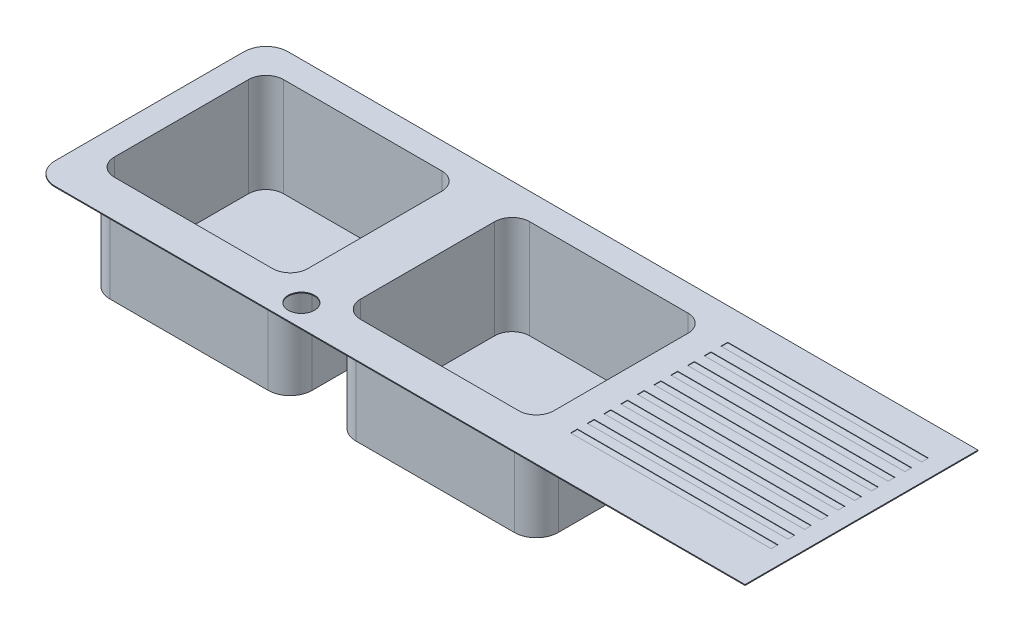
ISO-10303-21;
HEADER;
FILE_DESCRIPTION(('STEP AP214'),'2;1');
FILE_NAME('part.step','',(''),(''),'','','');
FILE_SCHEMA(('AUTOMOTIVE_DESIGN { 1 0 10303 214 1 1 1 1 }'));
ENDSEC;
DATA;
#1=APPLICATION_CONTEXT('core data for automotive mechanical design processes');
#2=APPLICATION_PROTOCOL_DEFINITION('international standard','automotive_design',2000,#1);
#3=PRODUCT_CONTEXT('',#1,'mechanical');
#4=PRODUCT('Part','Part','',(#3));
#5=PRODUCT_RELATED_PRODUCT_CATEGORY('part','',(#4));
#6=PRODUCT_DEFINITION_FORMATION('','',#4);
#7=PRODUCT_DEFINITION_CONTEXT('part definition',#1,'design');
#8=PRODUCT_DEFINITION('design','',#6,#7);
#9=PRODUCT_DEFINITION_SHAPE('','',#8);
#10=(LENGTH_UNIT() NAMED_UNIT(*) SI_UNIT(.MILLI.,.METRE.));
#11=(NAMED_UNIT(*) PLANE_ANGLE_UNIT() SI_UNIT($,.RADIAN.));
#12=(NAMED_UNIT(*) SI_UNIT($,.STERADIAN.) SOLID_ANGLE_UNIT());
#13=UNCERTAINTY_MEASURE_WITH_UNIT(LENGTH_MEASURE(1.E-05),#10,'distance_accuracy_value','');
#14=(GEOMETRIC_REPRESENTATION_CONTEXT(3) GLOBAL_UNCERTAINTY_ASSIGNED_CONTEXT((#13)) GLOBAL_UNIT_ASSIGNED_CONTEXT((#10,
#11,#12)) REPRESENTATION_CONTEXT('',''));
#15=CARTESIAN_POINT('',(0.,0.,0.));
#16=DIRECTION('',(0.,0.,1.));
#17=DIRECTION('',(1.,0.,0.));
#18=AXIS2_PLACEMENT_3D('',#15,#16,#17);
#19=CARTESIAN_POINT('',(0.,0.,-530.));
#20=DIRECTION('',(0.,-1.,0.));
#21=DIRECTION('',(0.,0.,-1.));
#22=AXIS2_PLACEMENT_3D('',#19,#20,#21);
#23=PLANE('',#22);
#24=CARTESIAN_POINT('',(460.,0.,-125.));
#25=DIRECTION('',(0.,-1.,0.));
#26=DIRECTION('',(0.,0.,-1.));
#27=AXIS2_PLACEMENT_3D('',#24,#25,#26);
#28=CIRCLE('',#27,50.);
#29=CARTESIAN_POINT('',(460.,0.,-75.0000000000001));
#30=VERTEX_POINT('',#29);
#31=CARTESIAN_POINT('',(510.,0.,-125.));
#32=VERTEX_POINT('',#31);
#33=EDGE_CURVE('E1087',#30,#32,#28,.F.);
#34=ORIENTED_EDGE('',*,*,#33,.T.);
#35=DIRECTION('',(0.,0.,1.));
#36=VECTOR('',#35,1.);
#37=CARTESIAN_POINT('',(510.,0.,-530.));
#38=LINE('',#37,#36);
#39=CARTESIAN_POINT('',(510.,0.,-430.));
#40=VERTEX_POINT('',#39);
#41=EDGE_CURVE('E1050',#40,#32,#38,.T.);
#42=ORIENTED_EDGE('',*,*,#41,.F.);
#43=CARTESIAN_POINT('',(460.,0.,-430.));
#44=DIRECTION('',(0.,-1.,0.));
#45=DIRECTION('',(0.,0.,-1.));
#46=AXIS2_PLACEMENT_3D('',#43,#44,#45);
#47=CIRCLE('',#46,50.);
#48=CARTESIAN_POINT('',(460.,0.,-480.));
#49=VERTEX_POINT('',#48);
#50=EDGE_CURVE('E1091',#40,#49,#47,.F.);
#51=ORIENTED_EDGE('',*,*,#50,.T.);
#52=DIRECTION('',(1.,0.,0.));
#53=VECTOR('',#52,1.);
#54=CARTESIAN_POINT('',(0.,0.,-480.));
#55=LINE('',#54,#53);
#56=CARTESIAN_POINT('',(100.,0.,-480.));
#57=VERTEX_POINT('',#56);
#58=EDGE_CURVE('E1053',#57,#49,#55,.T.);
#59=ORIENTED_EDGE('',*,*,#58,.F.);
#60=CARTESIAN_POINT('',(100.,0.,-430.));
#61=DIRECTION('',(0.,-1.,0.));
#62=DIRECTION('',(0.,0.,-1.));
#63=AXIS2_PLACEMENT_3D('',#60,#61,#62);
#64=CIRCLE('',#63,50.);
#65=CARTESIAN_POINT('',(50.,0.,-430.));
#66=VERTEX_POINT('',#65);
#67=EDGE_CURVE('E1093',#57,#66,#64,.F.);
#68=ORIENTED_EDGE('',*,*,#67,.T.);
#69=DIRECTION('',(0.,0.,-1.));
#70=VECTOR('',#69,1.);
#71=CARTESIAN_POINT('',(50.,0.,-530.));
#72=LINE('',#71,#70);
#73=CARTESIAN_POINT('',(50.,0.,-125.));
#74=VERTEX_POINT('',#73);
#75=EDGE_CURVE('E1056',#74,#66,#72,.T.);
#76=ORIENTED_EDGE('',*,*,#75,.F.);
#77=CARTESIAN_POINT('',(100.,0.,-125.));
#78=DIRECTION('',(0.,-1.,0.));
#79=DIRECTION('',(0.,0.,-1.));
#80=AXIS2_PLACEMENT_3D('',#77,#78,#79);
#81=CIRCLE('',#80,50.);
#82=CARTESIAN_POINT('',(100.,0.,-75.));
#83=VERTEX_POINT('',#82);
#84=EDGE_CURVE('E1089',#74,#83,#81,.F.);
#85=ORIENTED_EDGE('',*,*,#84,.T.);
#86=DIRECTION('',(-1.,0.,0.));
#87=VECTOR('',#86,1.);
#88=CARTESIAN_POINT('',(0.,0.,-75.));
#89=LINE('',#88,#87);
#90=EDGE_CURVE('E1044',#30,#83,#89,.T.);
#91=ORIENTED_EDGE('',*,*,#90,.F.);
#92=EDGE_LOOP('',(#34,#42,#51,#59,#68,#76,#85,#91));
#93=FACE_BOUND('',#92,.T.);
#94=DIRECTION('',(0.,0.,-1.));
#95=VECTOR('',#94,1.);
#96=CARTESIAN_POINT('',(1060.,0.,0.));
#97=LINE('',#96,#95);
#98=CARTESIAN_POINT('',(1060.,0.,0.));
#99=VERTEX_POINT('',#98);
#100=CARTESIAN_POINT('',(1060.,0.,-530.));
#101=VERTEX_POINT('',#100);
#102=EDGE_CURVE('E844',#99,#101,#97,.T.);
#103=ORIENTED_EDGE('',*,*,#102,.F.);
#104=DIRECTION('',(1.,0.,0.));
#105=VECTOR('',#104,1.);
#106=CARTESIAN_POINT('',(0.,0.,0.));
#107=LINE('',#106,#105);
#108=CARTESIAN_POINT('',(-510.,0.,0.));
#109=VERTEX_POINT('',#108);
#110=EDGE_CURVE('E1037',#109,#99,#107,.T.);
#111=ORIENTED_EDGE('',*,*,#110,.F.);
#112=CARTESIAN_POINT('',(-510.,0.,-50.));
#113=DIRECTION('',(0.,-1.,0.));
#114=DIRECTION('',(0.,0.,-1.));
#115=AXIS2_PLACEMENT_3D('',#112,#113,#114);
#116=CIRCLE('',#115,50.);
#117=CARTESIAN_POINT('',(-560.,0.,-50.));
#118=VERTEX_POINT('',#117);
#119=EDGE_CURVE('E1112',#109,#118,#116,.T.);
#120=ORIENTED_EDGE('',*,*,#119,.T.);
#121=DIRECTION('',(0.,0.,-1.));
#122=VECTOR('',#121,1.);
#123=CARTESIAN_POINT('',(-560.,0.,0.));
#124=LINE('',#123,#122);
#125=CARTESIAN_POINT('',(-560.,0.,-480.));
#126=VERTEX_POINT('',#125);
#127=EDGE_CURVE('E1019',#118,#126,#124,.T.);
#128=ORIENTED_EDGE('',*,*,#127,.T.);
#129=CARTESIAN_POINT('',(-510.,0.,-480.));
#130=DIRECTION('',(0.,-1.,0.));
#131=DIRECTION('',(0.,0.,-1.));
#132=AXIS2_PLACEMENT_3D('',#129,#130,#131);
#133=CIRCLE('',#132,50.);
#134=CARTESIAN_POINT('',(-510.,0.,-530.));
#135=VERTEX_POINT('',#134);
#136=EDGE_CURVE('E1114',#126,#135,#133,.T.);
#137=ORIENTED_EDGE('',*,*,#136,.T.);
#138=DIRECTION('',(-1.,0.,0.));
#139=VECTOR('',#138,1.);
#140=CARTESIAN_POINT('',(0.,0.,-530.));
#141=LINE('',#140,#139);
#142=EDGE_CURVE('E1041',#101,#135,#141,.T.);
#143=ORIENTED_EDGE('',*,*,#142,.F.);
#144=EDGE_LOOP('',(#103,#111,#120,#128,#137,#143));
#145=FACE_BOUND('',#144,.T.);
#146=CARTESIAN_POINT('',(0.,0.,-50.5007498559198));
#147=DIRECTION('',(0.,-1.,0.));
#148=DIRECTION('',(0.,0.,-1.));
#149=AXIS2_PLACEMENT_3D('',#146,#147,#148);
#150=CIRCLE('',#149,29.8761380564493);
#151=CARTESIAN_POINT('',(0.,0.,-80.376887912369));
#152=VERTEX_POINT('',#151);
#153=EDGE_CURVE('E856',#152,#152,#150,.T.);
#154=ORIENTED_EDGE('',*,*,#153,.F.);
#155=EDGE_LOOP('',(#154));
#156=FACE_BOUND('',#155,.T.);
#157=DIRECTION('',(0.,0.,1.));
#158=VECTOR('',#157,1.);
#159=CARTESIAN_POINT('',(-510.,0.,-530.));
#160=LINE('',#159,#158);
#161=CARTESIAN_POINT('',(-510.,0.,-430.));
#162=VERTEX_POINT('',#161);
#163=CARTESIAN_POINT('',(-510.,0.,-125.));
#164=VERTEX_POINT('',#163);
#165=EDGE_CURVE('E1098',#162,#164,#160,.T.);
#166=ORIENTED_EDGE('',*,*,#165,.T.);
#167=CARTESIAN_POINT('',(-460.,0.,-125.));
#168=DIRECTION('',(0.,-1.,0.));
#169=DIRECTION('',(0.,0.,-1.));
#170=AXIS2_PLACEMENT_3D('',#167,#168,#169);
#171=CIRCLE('',#170,50.);
#172=CARTESIAN_POINT('',(-460.,0.,-75.0000000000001));
#173=VERTEX_POINT('',#172);
#174=EDGE_CURVE('E1153',#164,#173,#171,.F.);
#175=ORIENTED_EDGE('',*,*,#174,.T.);
#176=DIRECTION('',(1.,0.,0.));
#177=VECTOR('',#176,1.);
#178=CARTESIAN_POINT('',(0.,0.,-75.));
#179=LINE('',#178,#177);
#180=CARTESIAN_POINT('',(-100.,0.,-75.));
#181=VERTEX_POINT('',#180);
#182=EDGE_CURVE('E1101',#173,#181,#179,.T.);
#183=ORIENTED_EDGE('',*,*,#182,.T.);
#184=CARTESIAN_POINT('',(-100.,0.,-125.));
#185=DIRECTION('',(0.,-1.,0.));
#186=DIRECTION('',(0.,0.,-1.));
#187=AXIS2_PLACEMENT_3D('',#184,#185,#186);
#188=CIRCLE('',#187,50.);
#189=CARTESIAN_POINT('',(-50.,0.,-125.));
#190=VERTEX_POINT('',#189);
#191=EDGE_CURVE('E1155',#181,#190,#188,.F.);
#192=ORIENTED_EDGE('',*,*,#191,.T.);
#193=DIRECTION('',(0.,0.,-1.));
#194=VECTOR('',#193,1.);
#195=CARTESIAN_POINT('',(-50.,0.,-530.));
#196=LINE('',#195,#194);
#197=CARTESIAN_POINT('',(-50.,0.,-430.));
#198=VERTEX_POINT('',#197);
#199=EDGE_CURVE('E1104',#190,#198,#196,.T.);
#200=ORIENTED_EDGE('',*,*,#199,.T.);
#201=CARTESIAN_POINT('',(-100.,0.,-430.));
#202=DIRECTION('',(0.,-1.,0.));
#203=DIRECTION('',(0.,0.,-1.));
#204=AXIS2_PLACEMENT_3D('',#201,#202,#203);
#205=CIRCLE('',#204,50.);
#206=CARTESIAN_POINT('',(-100.,0.,-480.));
#207=VERTEX_POINT('',#206);
#208=EDGE_CURVE('E11',#198,#207,#205,.F.);
#209=ORIENTED_EDGE('',*,*,#208,.T.);
#210=DIRECTION('',(-1.,0.,0.));
#211=VECTOR('',#210,1.);
#212=CARTESIAN_POINT('',(0.,0.,-480.));
#213=LINE('',#212,#211);
#214=CARTESIAN_POINT('',(-460.,0.,-480.));
#215=VERTEX_POINT('',#214);
#216=EDGE_CURVE('E1095',#207,#215,#213,.T.);
#217=ORIENTED_EDGE('',*,*,#216,.T.);
#218=CARTESIAN_POINT('',(-460.,0.,-430.));
#219=DIRECTION('',(0.,-1.,0.));
#220=DIRECTION('',(0.,0.,-1.));
#221=AXIS2_PLACEMENT_3D('',#218,#219,#220);
#222=CIRCLE('',#221,50.);
#223=EDGE_CURVE('E41',#215,#162,#222,.F.);
#224=ORIENTED_EDGE('',*,*,#223,.T.);
#225=EDGE_LOOP('',(#166,#175,#183,#192,#200,#209,#217,#224));
#226=FACE_BOUND('',#225,.T.);
#227=ADVANCED_FACE('F33',(#93,#145,#156,#226),#23,.T.);
#228=CARTESIAN_POINT('',(0.,2.,0.));
#229=DIRECTION('',(0.,0.,-1.));
#230=DIRECTION('',(-1.,0.,0.));
#231=AXIS2_PLACEMENT_3D('',#228,#229,#230);
#232=PLANE('',#231);
#233=DIRECTION('',(1.,0.,0.));
#234=VECTOR('',#233,1.);
#235=CARTESIAN_POINT('',(0.,2.,0.));
#236=LINE('',#235,#234);
#237=CARTESIAN_POINT('',(-510.,2.,0.));
#238=VERTEX_POINT('',#237);
#239=CARTESIAN_POINT('',(1060.,2.,0.));
#240=VERTEX_POINT('',#239);
#241=EDGE_CURVE('E1038',#238,#240,#236,.T.);
#242=ORIENTED_EDGE('',*,*,#241,.F.);
#243=DIRECTION('',(0.,-1.,0.));
#244=VECTOR('',#243,1.);
#245=CARTESIAN_POINT('',(-510.,0.,0.));
#246=LINE('',#245,#244);
#247=EDGE_CURVE('E1140',#238,#109,#246,.T.);
#248=ORIENTED_EDGE('',*,*,#247,.T.);
#249=ORIENTED_EDGE('',*,*,#110,.T.);
#250=DIRECTION('',(0.,-1.,0.));
#251=VECTOR('',#250,1.);
#252=CARTESIAN_POINT('',(1060.,0.,0.));
#253=LINE('',#252,#251);
#254=EDGE_CURVE('E835',#240,#99,#253,.T.);
#255=ORIENTED_EDGE('',*,*,#254,.F.);
#256=EDGE_LOOP('',(#242,#248,#249,#255));
#257=FACE_BOUND('',#256,.T.);
#258=ADVANCED_FACE('F1207',(#257),#232,.F.);
#259=CARTESIAN_POINT('',(0.,2.,-530.));
#260=DIRECTION('',(0.,0.,1.));
#261=DIRECTION('',(1.,0.,0.));
#262=AXIS2_PLACEMENT_3D('',#259,#260,#261);
#263=PLANE('',#262);
#264=ORIENTED_EDGE('',*,*,#142,.T.);
#265=DIRECTION('',(0.,-1.,0.));
#266=VECTOR('',#265,1.);
#267=CARTESIAN_POINT('',(-510.,2.,-530.));
#268=LINE('',#267,#266);
#269=CARTESIAN_POINT('',(-510.,2.,-530.));
#270=VERTEX_POINT('',#269);
#271=EDGE_CURVE('E1116',#135,#270,#268,.F.);
#272=ORIENTED_EDGE('',*,*,#271,.T.);
#273=DIRECTION('',(-1.,0.,0.));
#274=VECTOR('',#273,1.);
#275=CARTESIAN_POINT('',(0.,2.,-530.));
#276=LINE('',#275,#274);
#277=CARTESIAN_POINT('',(1060.,2.,-530.));
#278=VERTEX_POINT('',#277);
#279=EDGE_CURVE('E1040',#278,#270,#276,.T.);
#280=ORIENTED_EDGE('',*,*,#279,.F.);
#281=DIRECTION('',(0.,1.,0.));
#282=VECTOR('',#281,1.);
#283=CARTESIAN_POINT('',(1060.,0.,-530.));
#284=LINE('',#283,#282);
#285=EDGE_CURVE('E847',#101,#278,#284,.T.);
#286=ORIENTED_EDGE('',*,*,#285,.F.);
#287=EDGE_LOOP('',(#264,#272,#280,#286));
#288=FACE_BOUND('',#287,.T.);
#289=ADVANCED_FACE('F1213',(#288),#263,.F.);
#290=CARTESIAN_POINT('',(0.,2.,-530.));
#291=DIRECTION('',(0.,-1.,0.));
#292=DIRECTION('',(0.,0.,-1.));
#293=AXIS2_PLACEMENT_3D('',#290,#291,#292);
#294=PLANE('',#293);
#295=DIRECTION('',(1.,0.,0.));
#296=VECTOR('',#295,1.);
#297=CARTESIAN_POINT('',(562.860691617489,2.,-442.260811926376));
#298=LINE('',#297,#296);
#299=CARTESIAN_POINT('',(562.860691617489,2.,-442.260811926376));
#300=VERTEX_POINT('',#299);
#301=CARTESIAN_POINT('',(1019.25104191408,2.,-442.260811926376));
#302=VERTEX_POINT('',#301);
#303=EDGE_CURVE('E546',#300,#302,#298,.T.);
#304=ORIENTED_EDGE('',*,*,#303,.F.);
#305=DIRECTION('',(0.,0.,1.));
#306=VECTOR('',#305,1.);
#307=CARTESIAN_POINT('',(562.860691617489,2.,-442.260811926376));
#308=LINE('',#307,#306);
#309=CARTESIAN_POINT('',(562.860691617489,2.,-457.708657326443));
#310=VERTEX_POINT('',#309);
#311=EDGE_CURVE('E48',#310,#300,#308,.T.);
#312=ORIENTED_EDGE('',*,*,#311,.F.);
#313=DIRECTION('',(-1.,0.,0.));
#314=VECTOR('',#313,1.);
#315=CARTESIAN_POINT('',(562.860691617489,2.,-457.708657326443));
#316=LINE('',#315,#314);
#317=CARTESIAN_POINT('',(1019.25104191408,2.,-457.708657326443));
#318=VERTEX_POINT('',#317);
#319=EDGE_CURVE('E537',#318,#310,#316,.T.);
#320=ORIENTED_EDGE('',*,*,#319,.F.);
#321=DIRECTION('',(0.,0.,-1.));
#322=VECTOR('',#321,1.);
#323=CARTESIAN_POINT('',(1019.25104191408,2.,-442.260811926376));
#324=LINE('',#323,#322);
#325=EDGE_CURVE('E540',#302,#318,#324,.T.);
#326=ORIENTED_EDGE('',*,*,#325,.F.);
#327=EDGE_LOOP('',(#304,#312,#320,#326));
#328=FACE_BOUND('',#327,.T.);
#329=DIRECTION('',(1.,0.,0.));
#330=VECTOR('',#329,1.);
#331=CARTESIAN_POINT('',(562.860691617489,2.,-404.260811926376));
#332=LINE('',#331,#330);
#333=CARTESIAN_POINT('',(562.860691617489,2.,-404.260811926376));
#334=VERTEX_POINT('',#333);
#335=CARTESIAN_POINT('',(1019.25104191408,2.,-404.260811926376));
#336=VERTEX_POINT('',#335);
#337=EDGE_CURVE('E570',#334,#336,#332,.T.);
#338=ORIENTED_EDGE('',*,*,#337,.F.);
#339=DIRECTION('',(0.,0.,1.));
#340=VECTOR('',#339,1.);
#341=CARTESIAN_POINT('',(562.860691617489,2.,-404.260811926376));
#342=LINE('',#341,#340);
#343=CARTESIAN_POINT('',(562.860691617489,2.,-419.708657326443));
#344=VERTEX_POINT('',#343);
#345=EDGE_CURVE('E56',#344,#334,#342,.T.);
#346=ORIENTED_EDGE('',*,*,#345,.F.);
#347=DIRECTION('',(-1.,0.,0.));
#348=VECTOR('',#347,1.);
#349=CARTESIAN_POINT('',(562.860691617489,2.,-419.708657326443));
#350=LINE('',#349,#348);
#351=CARTESIAN_POINT('',(1019.25104191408,2.,-419.708657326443));
#352=VERTEX_POINT('',#351);
#353=EDGE_CURVE('E559',#352,#344,#350,.T.);
#354=ORIENTED_EDGE('',*,*,#353,.F.);
#355=DIRECTION('',(0.,0.,-1.));
#356=VECTOR('',#355,1.);
#357=CARTESIAN_POINT('',(1019.25104191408,2.,-404.260811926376));
#358=LINE('',#357,#356);
#359=EDGE_CURVE('E573',#336,#352,#358,.T.);
#360=ORIENTED_EDGE('',*,*,#359,.F.);
#361=EDGE_LOOP('',(#338,#346,#354,#360));
#362=FACE_BOUND('',#361,.T.);
#363=DIRECTION('',(1.,0.,0.));
#364=VECTOR('',#363,1.);
#365=CARTESIAN_POINT('',(562.860691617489,2.,-366.260811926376));
#366=LINE('',#365,#364);
#367=CARTESIAN_POINT('',(562.860691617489,2.,-366.260811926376));
#368=VERTEX_POINT('',#367);
#369=CARTESIAN_POINT('',(1019.25104191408,2.,-366.260811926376));
#370=VERTEX_POINT('',#369);
#371=EDGE_CURVE('E601',#368,#370,#366,.T.);
#372=ORIENTED_EDGE('',*,*,#371,.F.);
#373=DIRECTION('',(0.,0.,1.));
#374=VECTOR('',#373,1.);
#375=CARTESIAN_POINT('',(562.860691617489,2.,-366.260811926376));
#376=LINE('',#375,#374);
#377=CARTESIAN_POINT('',(562.860691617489,2.,-381.708657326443));
#378=VERTEX_POINT('',#377);
#379=EDGE_CURVE('E580',#378,#368,#376,.T.);
#380=ORIENTED_EDGE('',*,*,#379,.F.);
#381=DIRECTION('',(-1.,0.,0.));
#382=VECTOR('',#381,1.);
#383=CARTESIAN_POINT('',(562.860691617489,2.,-381.708657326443));
#384=LINE('',#383,#382);
#385=CARTESIAN_POINT('',(1019.25104191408,2.,-381.708657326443));
#386=VERTEX_POINT('',#385);
#387=EDGE_CURVE('E590',#386,#378,#384,.T.);
#388=ORIENTED_EDGE('',*,*,#387,.F.);
#389=DIRECTION('',(0.,0.,-1.));
#390=VECTOR('',#389,1.);
#391=CARTESIAN_POINT('',(1019.25104191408,2.,-366.260811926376));
#392=LINE('',#391,#390);
#393=EDGE_CURVE('E604',#370,#386,#392,.T.);
#394=ORIENTED_EDGE('',*,*,#393,.F.);
#395=EDGE_LOOP('',(#372,#380,#388,#394));
#396=FACE_BOUND('',#395,.T.);
#397=DIRECTION('',(1.,0.,0.));
#398=VECTOR('',#397,1.);
#399=CARTESIAN_POINT('',(562.86069161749,2.,-328.260811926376));
#400=LINE('',#399,#398);
#401=CARTESIAN_POINT('',(562.86069161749,2.,-328.260811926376));
#402=VERTEX_POINT('',#401);
#403=CARTESIAN_POINT('',(1019.25104191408,2.,-328.260811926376));
#404=VERTEX_POINT('',#403);
#405=EDGE_CURVE('E633',#402,#404,#400,.T.);
#406=ORIENTED_EDGE('',*,*,#405,.F.);
#407=DIRECTION('',(0.,0.,1.));
#408=VECTOR('',#407,1.);
#409=CARTESIAN_POINT('',(562.86069161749,2.,-328.260811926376));
#410=LINE('',#409,#408);
#411=CARTESIAN_POINT('',(562.86069161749,2.,-343.708657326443));
#412=VERTEX_POINT('',#411);
#413=EDGE_CURVE('E611',#412,#402,#410,.T.);
#414=ORIENTED_EDGE('',*,*,#413,.F.);
#415=DIRECTION('',(-1.,0.,0.));
#416=VECTOR('',#415,1.);
#417=CARTESIAN_POINT('',(562.86069161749,2.,-343.708657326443));
#418=LINE('',#417,#416);
#419=CARTESIAN_POINT('',(1019.25104191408,2.,-343.708657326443));
#420=VERTEX_POINT('',#419);
#421=EDGE_CURVE('E622',#420,#412,#418,.T.);
#422=ORIENTED_EDGE('',*,*,#421,.F.);
#423=DIRECTION('',(0.,0.,-1.));
#424=VECTOR('',#423,1.);
#425=CARTESIAN_POINT('',(1019.25104191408,2.,-328.260811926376));
#426=LINE('',#425,#424);
#427=EDGE_CURVE('E636',#404,#420,#426,.T.);
#428=ORIENTED_EDGE('',*,*,#427,.F.);
#429=EDGE_LOOP('',(#406,#414,#422,#428));
#430=FACE_BOUND('',#429,.T.);
#431=DIRECTION('',(1.,0.,0.));
#432=VECTOR('',#431,1.);
#433=CARTESIAN_POINT('',(562.86069161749,2.,-290.260811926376));
#434=LINE('',#433,#432);
#435=CARTESIAN_POINT('',(562.86069161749,2.,-290.260811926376));
#436=VERTEX_POINT('',#435);
#437=CARTESIAN_POINT('',(1019.25104191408,2.,-290.260811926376));
#438=VERTEX_POINT('',#437);
#439=EDGE_CURVE('E665',#436,#438,#434,.T.);
#440=ORIENTED_EDGE('',*,*,#439,.F.);
#441=DIRECTION('',(0.,0.,1.));
#442=VECTOR('',#441,1.);
#443=CARTESIAN_POINT('',(562.86069161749,2.,-290.260811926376));
#444=LINE('',#443,#442);
#445=CARTESIAN_POINT('',(562.86069161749,2.,-305.708657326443));
#446=VERTEX_POINT('',#445);
#447=EDGE_CURVE('E643',#446,#436,#444,.T.);
#448=ORIENTED_EDGE('',*,*,#447,.F.);
#449=DIRECTION('',(-1.,0.,0.));
#450=VECTOR('',#449,1.);
#451=CARTESIAN_POINT('',(562.86069161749,2.,-305.708657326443));
#452=LINE('',#451,#450);
#453=CARTESIAN_POINT('',(1019.25104191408,2.,-305.708657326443));
#454=VERTEX_POINT('',#453);
#455=EDGE_CURVE('E654',#454,#446,#452,.T.);
#456=ORIENTED_EDGE('',*,*,#455,.F.);
#457=DIRECTION('',(0.,0.,-1.));
#458=VECTOR('',#457,1.);
#459=CARTESIAN_POINT('',(1019.25104191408,2.,-290.260811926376));
#460=LINE('',#459,#458);
#461=EDGE_CURVE('E668',#438,#454,#460,.T.);
#462=ORIENTED_EDGE('',*,*,#461,.F.);
#463=EDGE_LOOP('',(#440,#448,#456,#462));
#464=FACE_BOUND('',#463,.T.);
#465=DIRECTION('',(1.,0.,0.));
#466=VECTOR('',#465,1.);
#467=CARTESIAN_POINT('',(562.86069161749,2.,-252.260811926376));
#468=LINE('',#467,#466);
#469=CARTESIAN_POINT('',(562.86069161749,2.,-252.260811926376));
#470=VERTEX_POINT('',#469);
#471=CARTESIAN_POINT('',(1019.25104191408,2.,-252.260811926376));
#472=VERTEX_POINT('',#471);
#473=EDGE_CURVE('E697',#470,#472,#468,.T.);
#474=ORIENTED_EDGE('',*,*,#473,.F.);
#475=DIRECTION('',(0.,0.,1.));
#476=VECTOR('',#475,1.);
#477=CARTESIAN_POINT('',(562.86069161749,2.,-252.260811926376));
#478=LINE('',#477,#476);
#479=CARTESIAN_POINT('',(562.86069161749,2.,-267.708657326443));
#480=VERTEX_POINT('',#479);
#481=EDGE_CURVE('E675',#480,#470,#478,.T.);
#482=ORIENTED_EDGE('',*,*,#481,.F.);
#483=DIRECTION('',(-1.,0.,0.));
#484=VECTOR('',#483,1.);
#485=CARTESIAN_POINT('',(562.86069161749,2.,-267.708657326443));
#486=LINE('',#485,#484);
#487=CARTESIAN_POINT('',(1019.25104191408,2.,-267.708657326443));
#488=VERTEX_POINT('',#487);
#489=EDGE_CURVE('E686',#488,#480,#486,.T.);
#490=ORIENTED_EDGE('',*,*,#489,.F.);
#491=DIRECTION('',(0.,0.,-1.));
#492=VECTOR('',#491,1.);
#493=CARTESIAN_POINT('',(1019.25104191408,2.,-252.260811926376));
#494=LINE('',#493,#492);
#495=EDGE_CURVE('E700',#472,#488,#494,.T.);
#496=ORIENTED_EDGE('',*,*,#495,.F.);
#497=EDGE_LOOP('',(#474,#482,#490,#496));
#498=FACE_BOUND('',#497,.T.);
#499=DIRECTION('',(1.,0.,0.));
#500=VECTOR('',#499,1.);
#501=CARTESIAN_POINT('',(562.86069161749,2.,-214.260811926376));
#502=LINE('',#501,#500);
#503=CARTESIAN_POINT('',(562.86069161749,2.,-214.260811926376));
#504=VERTEX_POINT('',#503);
#505=CARTESIAN_POINT('',(1019.25104191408,2.,-214.260811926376));
#506=VERTEX_POINT('',#505);
#507=EDGE_CURVE('E729',#504,#506,#502,.T.);
#508=ORIENTED_EDGE('',*,*,#507,.F.);
#509=DIRECTION('',(0.,0.,1.));
#510=VECTOR('',#509,1.);
#511=CARTESIAN_POINT('',(562.86069161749,2.,-214.260811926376));
#512=LINE('',#511,#510);
#513=CARTESIAN_POINT('',(562.86069161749,2.,-229.708657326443));
#514=VERTEX_POINT('',#513);
#515=EDGE_CURVE('E707',#514,#504,#512,.T.);
#516=ORIENTED_EDGE('',*,*,#515,.F.);
#517=DIRECTION('',(-1.,0.,0.));
#518=VECTOR('',#517,1.);
#519=CARTESIAN_POINT('',(562.86069161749,2.,-229.708657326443));
#520=LINE('',#519,#518);
#521=CARTESIAN_POINT('',(1019.25104191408,2.,-229.708657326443));
#522=VERTEX_POINT('',#521);
#523=EDGE_CURVE('E718',#522,#514,#520,.T.);
#524=ORIENTED_EDGE('',*,*,#523,.F.);
#525=DIRECTION('',(0.,0.,-1.));
#526=VECTOR('',#525,1.);
#527=CARTESIAN_POINT('',(1019.25104191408,2.,-214.260811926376));
#528=LINE('',#527,#526);
#529=EDGE_CURVE('E732',#506,#522,#528,.T.);
#530=ORIENTED_EDGE('',*,*,#529,.F.);
#531=EDGE_LOOP('',(#508,#516,#524,#530));
#532=FACE_BOUND('',#531,.T.);
#533=DIRECTION('',(1.,0.,0.));
#534=VECTOR('',#533,1.);
#535=CARTESIAN_POINT('',(562.86069161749,2.,-176.260811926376));
#536=LINE('',#535,#534);
#537=CARTESIAN_POINT('',(562.86069161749,2.,-176.260811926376));
#538=VERTEX_POINT('',#537);
#539=CARTESIAN_POINT('',(1019.25104191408,2.,-176.260811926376));
#540=VERTEX_POINT('',#539);
#541=EDGE_CURVE('E761',#538,#540,#536,.T.);
#542=ORIENTED_EDGE('',*,*,#541,.F.);
#543=DIRECTION('',(0.,0.,1.));
#544=VECTOR('',#543,1.);
#545=CARTESIAN_POINT('',(562.86069161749,2.,-176.260811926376));
#546=LINE('',#545,#544);
#547=CARTESIAN_POINT('',(562.86069161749,2.,-191.708657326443));
#548=VERTEX_POINT('',#547);
#549=EDGE_CURVE('E739',#548,#538,#546,.T.);
#550=ORIENTED_EDGE('',*,*,#549,.F.);
#551=DIRECTION('',(-1.,0.,0.));
#552=VECTOR('',#551,1.);
#553=CARTESIAN_POINT('',(562.86069161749,2.,-191.708657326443));
#554=LINE('',#553,#552);
#555=CARTESIAN_POINT('',(1019.25104191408,2.,-191.708657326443));
#556=VERTEX_POINT('',#555);
#557=EDGE_CURVE('E750',#556,#548,#554,.T.);
#558=ORIENTED_EDGE('',*,*,#557,.F.);
#559=DIRECTION('',(0.,0.,-1.));
#560=VECTOR('',#559,1.);
#561=CARTESIAN_POINT('',(1019.25104191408,2.,-176.260811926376));
#562=LINE('',#561,#560);
#563=EDGE_CURVE('E764',#540,#556,#562,.T.);
#564=ORIENTED_EDGE('',*,*,#563,.F.);
#565=EDGE_LOOP('',(#542,#550,#558,#564));
#566=FACE_BOUND('',#565,.T.);
#567=DIRECTION('',(1.,0.,0.));
#568=VECTOR('',#567,1.);
#569=CARTESIAN_POINT('',(562.86069161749,2.,-138.260811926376));
#570=LINE('',#569,#568);
#571=CARTESIAN_POINT('',(562.86069161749,2.,-138.260811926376));
#572=VERTEX_POINT('',#571);
#573=CARTESIAN_POINT('',(1019.25104191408,2.,-138.260811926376));
#574=VERTEX_POINT('',#573);
#575=EDGE_CURVE('E793',#572,#574,#570,.T.);
#576=ORIENTED_EDGE('',*,*,#575,.F.);
#577=DIRECTION('',(0.,0.,1.));
#578=VECTOR('',#577,1.);
#579=CARTESIAN_POINT('',(562.86069161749,2.,-138.260811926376));
#580=LINE('',#579,#578);
#581=CARTESIAN_POINT('',(562.86069161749,2.,-153.708657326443));
#582=VERTEX_POINT('',#581);
#583=EDGE_CURVE('E771',#582,#572,#580,.T.);
#584=ORIENTED_EDGE('',*,*,#583,.F.);
#585=DIRECTION('',(-1.,0.,0.));
#586=VECTOR('',#585,1.);
#587=CARTESIAN_POINT('',(562.86069161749,2.,-153.708657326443));
#588=LINE('',#587,#586);
#589=CARTESIAN_POINT('',(1019.25104191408,2.,-153.708657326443));
#590=VERTEX_POINT('',#589);
#591=EDGE_CURVE('E782',#590,#582,#588,.T.);
#592=ORIENTED_EDGE('',*,*,#591,.F.);
#593=DIRECTION('',(0.,0.,-1.));
#594=VECTOR('',#593,1.);
#595=CARTESIAN_POINT('',(1019.25104191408,2.,-138.260811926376));
#596=LINE('',#595,#594);
#597=EDGE_CURVE('E796',#574,#590,#596,.T.);
#598=ORIENTED_EDGE('',*,*,#597,.F.);
#599=EDGE_LOOP('',(#576,#584,#592,#598));
#600=FACE_BOUND('',#599,.T.);
#601=DIRECTION('',(1.,0.,0.));
#602=VECTOR('',#601,1.);
#603=CARTESIAN_POINT('',(562.86069161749,2.,-100.260811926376));
#604=LINE('',#603,#602);
#605=CARTESIAN_POINT('',(562.86069161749,2.,-100.260811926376));
#606=VERTEX_POINT('',#605);
#607=CARTESIAN_POINT('',(1019.25104191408,2.,-100.260811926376));
#608=VERTEX_POINT('',#607);
#609=EDGE_CURVE('E825',#606,#608,#604,.T.);
#610=ORIENTED_EDGE('',*,*,#609,.F.);
#611=DIRECTION('',(0.,0.,1.));
#612=VECTOR('',#611,1.);
#613=CARTESIAN_POINT('',(562.86069161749,2.,-100.260811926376));
#614=LINE('',#613,#612);
#615=CARTESIAN_POINT('',(562.86069161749,2.,-115.708657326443));
#616=VERTEX_POINT('',#615);
#617=EDGE_CURVE('E803',#616,#606,#614,.T.);
#618=ORIENTED_EDGE('',*,*,#617,.F.);
#619=DIRECTION('',(-1.,0.,0.));
#620=VECTOR('',#619,1.);
#621=CARTESIAN_POINT('',(562.86069161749,2.,-115.708657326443));
#622=LINE('',#621,#620);
#623=CARTESIAN_POINT('',(1019.25104191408,2.,-115.708657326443));
#624=VERTEX_POINT('',#623);
#625=EDGE_CURVE('E814',#624,#616,#622,.T.);
#626=ORIENTED_EDGE('',*,*,#625,.F.);
#627=DIRECTION('',(0.,0.,-1.));
#628=VECTOR('',#627,1.);
#629=CARTESIAN_POINT('',(1019.25104191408,2.,-100.260811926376));
#630=LINE('',#629,#628);
#631=EDGE_CURVE('E828',#608,#624,#630,.T.);
#632=ORIENTED_EDGE('',*,*,#631,.F.);
#633=EDGE_LOOP('',(#610,#618,#626,#632));
#634=FACE_BOUND('',#633,.T.);
#635=CARTESIAN_POINT('',(0.,2.,-50.5007498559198));
#636=DIRECTION('',(0.,1.,0.));
#637=DIRECTION('',(0.,0.,1.));
#638=AXIS2_PLACEMENT_3D('',#635,#636,#637);
#639=CIRCLE('',#638,29.8761380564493);
#640=CARTESIAN_POINT('',(0.,2.,-20.6246117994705));
#641=VERTEX_POINT('',#640);
#642=EDGE_CURVE('E853',#641,#641,#639,.T.);
#643=ORIENTED_EDGE('',*,*,#642,.F.);
#644=EDGE_LOOP('',(#643));
#645=FACE_BOUND('',#644,.T.);
#646=DIRECTION('',(0.,0.,-1.));
#647=VECTOR('',#646,1.);
#648=CARTESIAN_POINT('',(59.9999999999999,2.,-530.));
#649=LINE('',#648,#647);
#650=CARTESIAN_POINT('',(60.,2.,-125.));
#651=VERTEX_POINT('',#650);
#652=CARTESIAN_POINT('',(60.,2.,-430.));
#653=VERTEX_POINT('',#652);
#654=EDGE_CURVE('E962',#651,#653,#649,.T.);
#655=ORIENTED_EDGE('',*,*,#654,.T.);
#656=CARTESIAN_POINT('',(100.,2.,-430.));
#657=DIRECTION('',(0.,-1.,0.));
#658=DIRECTION('',(0.,0.,-1.));
#659=AXIS2_PLACEMENT_3D('',#656,#657,#658);
#660=CIRCLE('',#659,40.);
#661=CARTESIAN_POINT('',(99.9999999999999,2.,-470.));
#662=VERTEX_POINT('',#661);
#663=EDGE_CURVE('E984',#653,#662,#660,.T.);
#664=ORIENTED_EDGE('',*,*,#663,.T.);
#665=DIRECTION('',(1.,0.,0.));
#666=VECTOR('',#665,1.);
#667=CARTESIAN_POINT('',(0.,2.,-470.));
#668=LINE('',#667,#666);
#669=CARTESIAN_POINT('',(460.,2.,-470.));
#670=VERTEX_POINT('',#669);
#671=EDGE_CURVE('E981',#662,#670,#668,.T.);
#672=ORIENTED_EDGE('',*,*,#671,.T.);
#673=CARTESIAN_POINT('',(460.,2.,-430.));
#674=DIRECTION('',(0.,-1.,0.));
#675=DIRECTION('',(0.,0.,-1.));
#676=AXIS2_PLACEMENT_3D('',#673,#674,#675);
#677=CIRCLE('',#676,40.);
#678=CARTESIAN_POINT('',(500.,2.,-430.));
#679=VERTEX_POINT('',#678);
#680=EDGE_CURVE('E978',#670,#679,#677,.T.);
#681=ORIENTED_EDGE('',*,*,#680,.T.);
#682=DIRECTION('',(0.,0.,1.));
#683=VECTOR('',#682,1.);
#684=CARTESIAN_POINT('',(500.,2.,-530.));
#685=LINE('',#684,#683);
#686=CARTESIAN_POINT('',(500.,2.,-125.));
#687=VERTEX_POINT('',#686);
#688=EDGE_CURVE('E975',#679,#687,#685,.T.);
#689=ORIENTED_EDGE('',*,*,#688,.T.);
#690=CARTESIAN_POINT('',(460.,2.,-125.));
#691=DIRECTION('',(0.,-1.,0.));
#692=DIRECTION('',(0.,0.,-1.));
#693=AXIS2_PLACEMENT_3D('',#690,#691,#692);
#694=CIRCLE('',#693,40.);
#695=CARTESIAN_POINT('',(460.,2.,-85.));
#696=VERTEX_POINT('',#695);
#697=EDGE_CURVE('E972',#687,#696,#694,.T.);
#698=ORIENTED_EDGE('',*,*,#697,.T.);
#699=DIRECTION('',(-1.,0.,0.));
#700=VECTOR('',#699,1.);
#701=CARTESIAN_POINT('',(0.,2.,-85.));
#702=LINE('',#701,#700);
#703=CARTESIAN_POINT('',(100.,2.,-85.));
#704=VERTEX_POINT('',#703);
#705=EDGE_CURVE('E969',#696,#704,#702,.T.);
#706=ORIENTED_EDGE('',*,*,#705,.T.);
#707=CARTESIAN_POINT('',(100.,2.,-125.));
#708=DIRECTION('',(0.,-1.,0.));
#709=DIRECTION('',(0.,0.,-1.));
#710=AXIS2_PLACEMENT_3D('',#707,#708,#709);
#711=CIRCLE('',#710,40.);
#712=EDGE_CURVE('E966',#704,#651,#711,.T.);
#713=ORIENTED_EDGE('',*,*,#712,.T.);
#714=EDGE_LOOP('',(#655,#664,#672,#681,#689,#698,#706,#713));
#715=FACE_BOUND('',#714,.T.);
#716=DIRECTION('',(0.,0.,1.));
#717=VECTOR('',#716,1.);
#718=CARTESIAN_POINT('',(-500.,2.,-530.));
#719=LINE('',#718,#717);
#720=CARTESIAN_POINT('',(-500.,2.,-430.));
#721=VERTEX_POINT('',#720);
#722=CARTESIAN_POINT('',(-500.,2.,-125.));
#723=VERTEX_POINT('',#722);
#724=EDGE_CURVE('E987',#721,#723,#719,.T.);
#725=ORIENTED_EDGE('',*,*,#724,.F.);
#726=CARTESIAN_POINT('',(-460.,2.,-430.));
#727=DIRECTION('',(0.,-1.,0.));
#728=DIRECTION('',(0.,0.,-1.));
#729=AXIS2_PLACEMENT_3D('',#726,#727,#728);
#730=CIRCLE('',#729,40.);
#731=CARTESIAN_POINT('',(-460.,2.,-470.));
#732=VERTEX_POINT('',#731);
#733=EDGE_CURVE('E1004',#721,#732,#730,.T.);
#734=ORIENTED_EDGE('',*,*,#733,.T.);
#735=DIRECTION('',(-1.,0.,0.));
#736=VECTOR('',#735,1.);
#737=CARTESIAN_POINT('',(0.,2.,-470.));
#738=LINE('',#737,#736);
#739=CARTESIAN_POINT('',(-100.,2.,-470.));
#740=VERTEX_POINT('',#739);
#741=EDGE_CURVE('E1002',#740,#732,#738,.T.);
#742=ORIENTED_EDGE('',*,*,#741,.F.);
#743=CARTESIAN_POINT('',(-100.,2.,-430.));
#744=DIRECTION('',(0.,-1.,0.));
#745=DIRECTION('',(0.,0.,-1.));
#746=AXIS2_PLACEMENT_3D('',#743,#744,#745);
#747=CIRCLE('',#746,40.);
#748=CARTESIAN_POINT('',(-60.,2.,-430.));
#749=VERTEX_POINT('',#748);
#750=EDGE_CURVE('E999',#740,#749,#747,.T.);
#751=ORIENTED_EDGE('',*,*,#750,.T.);
#752=DIRECTION('',(0.,0.,-1.));
#753=VECTOR('',#752,1.);
#754=CARTESIAN_POINT('',(-59.9999999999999,2.,-530.));
#755=LINE('',#754,#753);
#756=CARTESIAN_POINT('',(-60.,2.,-125.));
#757=VERTEX_POINT('',#756);
#758=EDGE_CURVE('E997',#757,#749,#755,.T.);
#759=ORIENTED_EDGE('',*,*,#758,.F.);
#760=CARTESIAN_POINT('',(-100.,2.,-125.));
#761=DIRECTION('',(0.,-1.,0.));
#762=DIRECTION('',(0.,0.,-1.));
#763=AXIS2_PLACEMENT_3D('',#760,#761,#762);
#764=CIRCLE('',#763,40.);
#765=CARTESIAN_POINT('',(-100.,2.,-85.));
#766=VERTEX_POINT('',#765);
#767=EDGE_CURVE('E994',#757,#766,#764,.T.);
#768=ORIENTED_EDGE('',*,*,#767,.T.);
#769=DIRECTION('',(1.,0.,0.));
#770=VECTOR('',#769,1.);
#771=CARTESIAN_POINT('',(0.,2.,-85.));
#772=LINE('',#771,#770);
#773=CARTESIAN_POINT('',(-460.,2.,-85.));
#774=VERTEX_POINT('',#773);
#775=EDGE_CURVE('E992',#774,#766,#772,.T.);
#776=ORIENTED_EDGE('',*,*,#775,.F.);
#777=CARTESIAN_POINT('',(-460.,2.,-125.));
#778=DIRECTION('',(0.,-1.,0.));
#779=DIRECTION('',(0.,0.,-1.));
#780=AXIS2_PLACEMENT_3D('',#777,#778,#779);
#781=CIRCLE('',#780,40.);
#782=EDGE_CURVE('E989',#774,#723,#781,.T.);
#783=ORIENTED_EDGE('',*,*,#782,.T.);
#784=EDGE_LOOP('',(#725,#734,#742,#751,#759,#768,#776,#783));
#785=FACE_BOUND('',#784,.T.);
#786=ORIENTED_EDGE('',*,*,#241,.T.);
#787=DIRECTION('',(0.,0.,1.));
#788=VECTOR('',#787,1.);
#789=CARTESIAN_POINT('',(1060.,2.,0.));
#790=LINE('',#789,#788);
#791=EDGE_CURVE('E850',#278,#240,#790,.T.);
#792=ORIENTED_EDGE('',*,*,#791,.F.);
#793=ORIENTED_EDGE('',*,*,#279,.T.);
#794=CARTESIAN_POINT('',(-510.,2.,-480.));
#795=DIRECTION('',(0.,-1.,0.));
#796=DIRECTION('',(0.,0.,-1.));
#797=AXIS2_PLACEMENT_3D('',#794,#795,#796);
#798=CIRCLE('',#797,50.);
#799=CARTESIAN_POINT('',(-560.,2.,-480.));
#800=VERTEX_POINT('',#799);
#801=EDGE_CURVE('E1120',#270,#800,#798,.F.);
#802=ORIENTED_EDGE('',*,*,#801,.T.);
#803=DIRECTION('',(0.,0.,-1.));
#804=VECTOR('',#803,1.);
#805=CARTESIAN_POINT('',(-560.,2.,0.));
#806=LINE('',#805,#804);
#807=CARTESIAN_POINT('',(-560.,2.,-50.));
#808=VERTEX_POINT('',#807);
#809=EDGE_CURVE('E1020',#808,#800,#806,.T.);
#810=ORIENTED_EDGE('',*,*,#809,.F.);
#811=CARTESIAN_POINT('',(-510.,2.,-50.));
#812=DIRECTION('',(0.,-1.,0.));
#813=DIRECTION('',(0.,0.,-1.));
#814=AXIS2_PLACEMENT_3D('',#811,#812,#813);
#815=CIRCLE('',#814,50.);
#816=EDGE_CURVE('E1118',#808,#238,#815,.F.);
#817=ORIENTED_EDGE('',*,*,#816,.T.);
#818=EDGE_LOOP('',(#786,#792,#793,#802,#810,#817));
#819=FACE_BOUND('',#818,.T.);
#820=ADVANCED_FACE('F1219',(#328,#362,#396,#430,#464,#498,#532,#566,#600,#634,#645,#715,#785,
#819),#294,.F.);
#821=CARTESIAN_POINT('',(50.,-233.,-75.));
#822=DIRECTION('',(-1.,0.,0.));
#823=DIRECTION('',(0.,0.,1.));
#824=AXIS2_PLACEMENT_3D('',#821,#822,#823);
#825=PLANE('',#824);
#826=DIRECTION('',(0.,0.,1.));
#827=VECTOR('',#826,1.);
#828=CARTESIAN_POINT('',(50.,-233.,-75.));
#829=LINE('',#828,#827);
#830=CARTESIAN_POINT('',(50.,-233.,-430.));
#831=VERTEX_POINT('',#830);
#832=CARTESIAN_POINT('',(50.,-233.,-125.));
#833=VERTEX_POINT('',#832);
#834=EDGE_CURVE('E1023',#831,#833,#829,.T.);
#835=ORIENTED_EDGE('',*,*,#834,.T.);
#836=DIRECTION('',(0.,1.,0.));
#837=VECTOR('',#836,1.);
#838=CARTESIAN_POINT('',(50.,-233.,-125.));
#839=LINE('',#838,#837);
#840=EDGE_CURVE('E1079',#833,#74,#839,.T.);
#841=ORIENTED_EDGE('',*,*,#840,.T.);
#842=ORIENTED_EDGE('',*,*,#75,.T.);
#843=DIRECTION('',(0.,1.,0.));
#844=VECTOR('',#843,1.);
#845=CARTESIAN_POINT('',(50.,-233.,-430.));
#846=LINE('',#845,#844);
#847=EDGE_CURVE('E1077',#66,#831,#846,.F.);
#848=ORIENTED_EDGE('',*,*,#847,.T.);
#849=EDGE_LOOP('',(#835,#841,#842,#848));
#850=FACE_BOUND('',#849,.T.);
#851=ADVANCED_FACE('F1273',(#850),#825,.T.);
#852=CARTESIAN_POINT('',(50.,-233.,-480.));
#853=DIRECTION('',(0.,0.,-1.));
#854=DIRECTION('',(-1.,0.,0.));
#855=AXIS2_PLACEMENT_3D('',#852,#853,#854);
#856=PLANE('',#855);
#857=ORIENTED_EDGE('',*,*,#58,.T.);
#858=DIRECTION('',(0.,1.,0.));
#859=VECTOR('',#858,1.);
#860=CARTESIAN_POINT('',(460.,-233.,-480.));
#861=LINE('',#860,#859);
#862=CARTESIAN_POINT('',(460.,-233.,-480.));
#863=VERTEX_POINT('',#862);
#864=EDGE_CURVE('E1085',#49,#863,#861,.F.);
#865=ORIENTED_EDGE('',*,*,#864,.T.);
#866=DIRECTION('',(-1.,0.,0.));
#867=VECTOR('',#866,1.);
#868=CARTESIAN_POINT('',(50.,-233.,-480.));
#869=LINE('',#868,#867);
#870=CARTESIAN_POINT('',(99.9999999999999,-233.,-480.));
#871=VERTEX_POINT('',#870);
#872=EDGE_CURVE('E1034',#863,#871,#869,.T.);
#873=ORIENTED_EDGE('',*,*,#872,.T.);
#874=DIRECTION('',(0.,1.,0.));
#875=VECTOR('',#874,1.);
#876=CARTESIAN_POINT('',(100.,-233.,-480.));
#877=LINE('',#876,#875);
#878=EDGE_CURVE('E1082',#871,#57,#877,.T.);
#879=ORIENTED_EDGE('',*,*,#878,.T.);
#880=EDGE_LOOP('',(#857,#865,#873,#879));
#881=FACE_BOUND('',#880,.T.);
#882=ADVANCED_FACE('F1255',(#881),#856,.T.);
#883=CARTESIAN_POINT('',(510.,-233.,-75.0000000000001));
#884=DIRECTION('',(1.,0.,0.));
#885=DIRECTION('',(0.,0.,-1.));
#886=AXIS2_PLACEMENT_3D('',#883,#884,#885);
#887=PLANE('',#886);
#888=ORIENTED_EDGE('',*,*,#41,.T.);
#889=DIRECTION('',(0.,1.,0.));
#890=VECTOR('',#889,1.);
#891=CARTESIAN_POINT('',(510.,-233.,-125.));
#892=LINE('',#891,#890);
#893=CARTESIAN_POINT('',(510.,-233.,-125.));
#894=VERTEX_POINT('',#893);
#895=EDGE_CURVE('E1067',#32,#894,#892,.F.);
#896=ORIENTED_EDGE('',*,*,#895,.T.);
#897=DIRECTION('',(0.,0.,-1.));
#898=VECTOR('',#897,1.);
#899=CARTESIAN_POINT('',(510.,-233.,-75.0000000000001));
#900=LINE('',#899,#898);
#901=CARTESIAN_POINT('',(510.,-233.,-430.));
#902=VERTEX_POINT('',#901);
#903=EDGE_CURVE('E1031',#894,#902,#900,.T.);
#904=ORIENTED_EDGE('',*,*,#903,.T.);
#905=DIRECTION('',(0.,1.,0.));
#906=VECTOR('',#905,1.);
#907=CARTESIAN_POINT('',(510.,-233.,-430.));
#908=LINE('',#907,#906);
#909=EDGE_CURVE('E1064',#902,#40,#908,.T.);
#910=ORIENTED_EDGE('',*,*,#909,.T.);
#911=EDGE_LOOP('',(#888,#896,#904,#910));
#912=FACE_BOUND('',#911,.T.);
#913=ADVANCED_FACE('F1261',(#912),#887,.T.);
#914=CARTESIAN_POINT('',(50.,-233.,-75.));
#915=DIRECTION('',(0.,0.,1.));
#916=DIRECTION('',(1.,0.,0.));
#917=AXIS2_PLACEMENT_3D('',#914,#915,#916);
#918=PLANE('',#917);
#919=DIRECTION('',(1.,0.,0.));
#920=VECTOR('',#919,1.);
#921=CARTESIAN_POINT('',(50.,-233.,-75.));
#922=LINE('',#921,#920);
#923=CARTESIAN_POINT('',(100.,-233.,-75.));
#924=VERTEX_POINT('',#923);
#925=CARTESIAN_POINT('',(460.,-233.,-75.0000000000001));
#926=VERTEX_POINT('',#925);
#927=EDGE_CURVE('E1028',#924,#926,#922,.T.);
#928=ORIENTED_EDGE('',*,*,#927,.T.);
#929=DIRECTION('',(0.,1.,0.));
#930=VECTOR('',#929,1.);
#931=CARTESIAN_POINT('',(460.,-233.,-75.0000000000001));
#932=LINE('',#931,#930);
#933=EDGE_CURVE('E1061',#926,#30,#932,.T.);
#934=ORIENTED_EDGE('',*,*,#933,.T.);
#935=ORIENTED_EDGE('',*,*,#90,.T.);
#936=DIRECTION('',(0.,1.,0.));
#937=VECTOR('',#936,1.);
#938=CARTESIAN_POINT('',(100.,-233.,-75.));
#939=LINE('',#938,#937);
#940=EDGE_CURVE('E1059',#83,#924,#939,.F.);
#941=ORIENTED_EDGE('',*,*,#940,.T.);
#942=EDGE_LOOP('',(#928,#934,#935,#941));
#943=FACE_BOUND('',#942,.T.);
#944=ADVANCED_FACE('F1268',(#943),#918,.T.);
#945=CARTESIAN_POINT('',(50.,-233.,-480.));
#946=DIRECTION('',(0.,-1.,0.));
#947=DIRECTION('',(0.,0.,-1.));
#948=AXIS2_PLACEMENT_3D('',#945,#946,#947);
#949=PLANE('',#948);
#950=CARTESIAN_POINT('',(160.,-233.,-165.78952725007));
#951=DIRECTION('',(0.,-1.,0.));
#952=DIRECTION('',(0.,0.,-1.));
#953=AXIS2_PLACEMENT_3D('',#950,#951,#952);
#954=CIRCLE('',#953,30.);
#955=CARTESIAN_POINT('',(160.,-233.,-195.78952725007));
#956=VERTEX_POINT('',#955);
#957=EDGE_CURVE('E868',#956,#956,#954,.T.);
#958=ORIENTED_EDGE('',*,*,#957,.F.);
#959=EDGE_LOOP('',(#958));
#960=FACE_BOUND('',#959,.T.);
#961=ORIENTED_EDGE('',*,*,#903,.F.);
#962=CARTESIAN_POINT('',(460.,-233.,-125.));
#963=DIRECTION('',(0.,-1.,0.));
#964=DIRECTION('',(0.,0.,-1.));
#965=AXIS2_PLACEMENT_3D('',#962,#963,#964);
#966=CIRCLE('',#965,50.);
#967=EDGE_CURVE('E1075',#894,#926,#966,.T.);
#968=ORIENTED_EDGE('',*,*,#967,.T.);
#969=ORIENTED_EDGE('',*,*,#927,.F.);
#970=CARTESIAN_POINT('',(100.,-233.,-125.));
#971=DIRECTION('',(0.,-1.,0.));
#972=DIRECTION('',(0.,0.,-1.));
#973=AXIS2_PLACEMENT_3D('',#970,#971,#972);
#974=CIRCLE('',#973,50.);
#975=EDGE_CURVE('E1073',#924,#833,#974,.T.);
#976=ORIENTED_EDGE('',*,*,#975,.T.);
#977=ORIENTED_EDGE('',*,*,#834,.F.);
#978=CARTESIAN_POINT('',(100.,-233.,-430.));
#979=DIRECTION('',(0.,-1.,0.));
#980=DIRECTION('',(0.,0.,-1.));
#981=AXIS2_PLACEMENT_3D('',#978,#979,#980);
#982=CIRCLE('',#981,50.);
#983=EDGE_CURVE('E1069',#831,#871,#982,.T.);
#984=ORIENTED_EDGE('',*,*,#983,.T.);
#985=ORIENTED_EDGE('',*,*,#872,.F.);
#986=CARTESIAN_POINT('',(460.,-233.,-430.));
#987=DIRECTION('',(0.,-1.,0.));
#988=DIRECTION('',(0.,0.,-1.));
#989=AXIS2_PLACEMENT_3D('',#986,#987,#988);
#990=CIRCLE('',#989,50.);
#991=EDGE_CURVE('E1071',#863,#902,#990,.T.);
#992=ORIENTED_EDGE('',*,*,#991,.T.);
#993=EDGE_LOOP('',(#961,#968,#969,#976,#977,#984,#985,#992));
#994=FACE_BOUND('',#993,.T.);
#995=ADVANCED_FACE('F1228',(#960,#994),#949,.T.);
#996=CARTESIAN_POINT('',(460.,-233.,-125.));
#997=DIRECTION('',(0.,1.,0.));
#998=DIRECTION('',(0.,0.,1.));
#999=AXIS2_PLACEMENT_3D('',#996,#997,#998);
#1000=CYLINDRICAL_SURFACE('',#999,50.);
#1001=ORIENTED_EDGE('',*,*,#967,.F.);
#1002=ORIENTED_EDGE('',*,*,#895,.F.);
#1003=ORIENTED_EDGE('',*,*,#33,.F.);
#1004=ORIENTED_EDGE('',*,*,#933,.F.);
#1005=EDGE_LOOP('',(#1001,#1002,#1003,#1004));
#1006=FACE_BOUND('',#1005,.T.);
#1007=ADVANCED_FACE('F1224',(#1006),#1000,.T.);
#1008=CARTESIAN_POINT('',(100.,-233.,-125.));
#1009=DIRECTION('',(0.,1.,0.));
#1010=DIRECTION('',(0.,0.,1.));
#1011=AXIS2_PLACEMENT_3D('',#1008,#1009,#1010);
#1012=CYLINDRICAL_SURFACE('',#1011,50.);
#1013=ORIENTED_EDGE('',*,*,#975,.F.);
#1014=ORIENTED_EDGE('',*,*,#940,.F.);
#1015=ORIENTED_EDGE('',*,*,#84,.F.);
#1016=ORIENTED_EDGE('',*,*,#840,.F.);
#1017=EDGE_LOOP('',(#1013,#1014,#1015,#1016));
#1018=FACE_BOUND('',#1017,.T.);
#1019=ADVANCED_FACE('F1227',(#1018),#1012,.T.);
#1020=CARTESIAN_POINT('',(460.,-233.,-430.));
#1021=DIRECTION('',(0.,1.,0.));
#1022=DIRECTION('',(0.,0.,1.));
#1023=AXIS2_PLACEMENT_3D('',#1020,#1021,#1022);
#1024=CYLINDRICAL_SURFACE('',#1023,50.);
#1025=ORIENTED_EDGE('',*,*,#991,.F.);
#1026=ORIENTED_EDGE('',*,*,#864,.F.);
#1027=ORIENTED_EDGE('',*,*,#50,.F.);
#1028=ORIENTED_EDGE('',*,*,#909,.F.);
#1029=EDGE_LOOP('',(#1025,#1026,#1027,#1028));
#1030=FACE_BOUND('',#1029,.T.);
#1031=ADVANCED_FACE('F1232',(#1030),#1024,.T.);
#1032=CARTESIAN_POINT('',(100.,-233.,-430.));
#1033=DIRECTION('',(0.,1.,0.));
#1034=DIRECTION('',(0.,0.,1.));
#1035=AXIS2_PLACEMENT_3D('',#1032,#1033,#1034);
#1036=CYLINDRICAL_SURFACE('',#1035,50.);
#1037=ORIENTED_EDGE('',*,*,#983,.F.);
#1038=ORIENTED_EDGE('',*,*,#847,.F.);
#1039=ORIENTED_EDGE('',*,*,#67,.F.);
#1040=ORIENTED_EDGE('',*,*,#878,.F.);
#1041=EDGE_LOOP('',(#1037,#1038,#1039,#1040));
#1042=FACE_BOUND('',#1041,.T.);
#1043=ADVANCED_FACE('F1236',(#1042),#1036,.T.);
#1044=CARTESIAN_POINT('',(-560.,2.,0.));
#1045=DIRECTION('',(-1.,0.,0.));
#1046=DIRECTION('',(0.,0.,1.));
#1047=AXIS2_PLACEMENT_3D('',#1044,#1045,#1046);
#1048=PLANE('',#1047);
#1049=ORIENTED_EDGE('',*,*,#809,.T.);
#1050=DIRECTION('',(0.,-1.,0.));
#1051=VECTOR('',#1050,1.);
#1052=CARTESIAN_POINT('',(-560.,0.,-480.));
#1053=LINE('',#1052,#1051);
#1054=EDGE_CURVE('E1109',#800,#126,#1053,.T.);
#1055=ORIENTED_EDGE('',*,*,#1054,.T.);
#1056=ORIENTED_EDGE('',*,*,#127,.F.);
#1057=DIRECTION('',(0.,-1.,0.));
#1058=VECTOR('',#1057,1.);
#1059=CARTESIAN_POINT('',(-560.,2.,-50.));
#1060=LINE('',#1059,#1058);
#1061=EDGE_CURVE('E1107',#118,#808,#1060,.F.);
#1062=ORIENTED_EDGE('',*,*,#1061,.T.);
#1063=EDGE_LOOP('',(#1049,#1055,#1056,#1062));
#1064=FACE_BOUND('',#1063,.T.);
#1065=ADVANCED_FACE('F1239',(#1064),#1048,.T.);
#1066=CARTESIAN_POINT('',(-50.,-233.,-75.));
#1067=DIRECTION('',(-1.,0.,0.));
#1068=DIRECTION('',(0.,0.,1.));
#1069=AXIS2_PLACEMENT_3D('',#1066,#1067,#1068);
#1070=PLANE('',#1069);
#1071=ORIENTED_EDGE('',*,*,#199,.F.);
#1072=DIRECTION('',(0.,1.,0.));
#1073=VECTOR('',#1072,1.);
#1074=CARTESIAN_POINT('',(-50.,-233.,-125.));
#1075=LINE('',#1074,#1073);
#1076=CARTESIAN_POINT('',(-50.,-233.,-125.));
#1077=VERTEX_POINT('',#1076);
#1078=EDGE_CURVE('E1146',#190,#1077,#1075,.F.);
#1079=ORIENTED_EDGE('',*,*,#1078,.T.);
#1080=DIRECTION('',(0.,0.,1.));
#1081=VECTOR('',#1080,1.);
#1082=CARTESIAN_POINT('',(-50.,-233.,-75.));
#1083=LINE('',#1082,#1081);
#1084=CARTESIAN_POINT('',(-50.,-233.,-430.));
#1085=VERTEX_POINT('',#1084);
#1086=EDGE_CURVE('E1007',#1085,#1077,#1083,.T.);
#1087=ORIENTED_EDGE('',*,*,#1086,.F.);
#1088=DIRECTION('',(0.,1.,0.));
#1089=VECTOR('',#1088,1.);
#1090=CARTESIAN_POINT('',(-50.,-233.,-430.));
#1091=LINE('',#1090,#1089);
#1092=EDGE_CURVE('E1143',#1085,#198,#1091,.T.);
#1093=ORIENTED_EDGE('',*,*,#1092,.T.);
#1094=EDGE_LOOP('',(#1071,#1079,#1087,#1093));
#1095=FACE_BOUND('',#1094,.T.);
#1096=ADVANCED_FACE('F1181',(#1095),#1070,.F.);
#1097=CARTESIAN_POINT('',(-50.,-233.,-75.));
#1098=DIRECTION('',(0.,0.,-1.));
#1099=DIRECTION('',(-1.,0.,0.));
#1100=AXIS2_PLACEMENT_3D('',#1097,#1098,#1099);
#1101=PLANE('',#1100);
#1102=ORIENTED_EDGE('',*,*,#182,.F.);
#1103=DIRECTION('',(0.,1.,0.));
#1104=VECTOR('',#1103,1.);
#1105=CARTESIAN_POINT('',(-460.,-233.,-75.0000000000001));
#1106=LINE('',#1105,#1104);
#1107=CARTESIAN_POINT('',(-460.,-233.,-75.0000000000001));
#1108=VERTEX_POINT('',#1107);
#1109=EDGE_CURVE('E1130',#173,#1108,#1106,.F.);
#1110=ORIENTED_EDGE('',*,*,#1109,.T.);
#1111=DIRECTION('',(-1.,0.,0.));
#1112=VECTOR('',#1111,1.);
#1113=CARTESIAN_POINT('',(-50.,-233.,-75.));
#1114=LINE('',#1113,#1112);
#1115=CARTESIAN_POINT('',(-100.,-233.,-75.));
#1116=VERTEX_POINT('',#1115);
#1117=EDGE_CURVE('E1016',#1116,#1108,#1114,.T.);
#1118=ORIENTED_EDGE('',*,*,#1117,.F.);
#1119=DIRECTION('',(0.,1.,0.));
#1120=VECTOR('',#1119,1.);
#1121=CARTESIAN_POINT('',(-100.,-233.,-75.));
#1122=LINE('',#1121,#1120);
#1123=EDGE_CURVE('E1127',#1116,#181,#1122,.T.);
#1124=ORIENTED_EDGE('',*,*,#1123,.T.);
#1125=EDGE_LOOP('',(#1102,#1110,#1118,#1124));
#1126=FACE_BOUND('',#1125,.T.);
#1127=ADVANCED_FACE('F1190',(#1126),#1101,.F.);
#1128=CARTESIAN_POINT('',(-510.,-233.,-75.0000000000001));
#1129=DIRECTION('',(1.,0.,0.));
#1130=DIRECTION('',(0.,0.,-1.));
#1131=AXIS2_PLACEMENT_3D('',#1128,#1129,#1130);
#1132=PLANE('',#1131);
#1133=DIRECTION('',(0.,0.,-1.));
#1134=VECTOR('',#1133,1.);
#1135=CARTESIAN_POINT('',(-510.,-233.,-75.0000000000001));
#1136=LINE('',#1135,#1134);
#1137=CARTESIAN_POINT('',(-510.,-233.,-125.));
#1138=VERTEX_POINT('',#1137);
#1139=CARTESIAN_POINT('',(-510.,-233.,-430.));
#1140=VERTEX_POINT('',#1139);
#1141=EDGE_CURVE('E1013',#1138,#1140,#1136,.T.);
#1142=ORIENTED_EDGE('',*,*,#1141,.F.);
#1143=DIRECTION('',(0.,1.,0.));
#1144=VECTOR('',#1143,1.);
#1145=CARTESIAN_POINT('',(-510.,-233.,-125.));
#1146=LINE('',#1145,#1144);
#1147=EDGE_CURVE('E1124',#1138,#164,#1146,.T.);
#1148=ORIENTED_EDGE('',*,*,#1147,.T.);
#1149=ORIENTED_EDGE('',*,*,#165,.F.);
#1150=DIRECTION('',(0.,1.,0.));
#1151=VECTOR('',#1150,1.);
#1152=CARTESIAN_POINT('',(-510.,-233.,-430.));
#1153=LINE('',#1152,#1151);
#1154=EDGE_CURVE('E1122',#162,#1140,#1153,.F.);
#1155=ORIENTED_EDGE('',*,*,#1154,.T.);
#1156=EDGE_LOOP('',(#1142,#1148,#1149,#1155));
#1157=FACE_BOUND('',#1156,.T.);
#1158=ADVANCED_FACE('F1164',(#1157),#1132,.F.);
#1159=CARTESIAN_POINT('',(-50.,-233.,-480.));
#1160=DIRECTION('',(0.,0.,1.));
#1161=DIRECTION('',(1.,0.,0.));
#1162=AXIS2_PLACEMENT_3D('',#1159,#1160,#1161);
#1163=PLANE('',#1162);
#1164=DIRECTION('',(1.,0.,0.));
#1165=VECTOR('',#1164,1.);
#1166=CARTESIAN_POINT('',(-50.,-233.,-480.));
#1167=LINE('',#1166,#1165);
#1168=CARTESIAN_POINT('',(-460.,-233.,-480.));
#1169=VERTEX_POINT('',#1168);
#1170=CARTESIAN_POINT('',(-99.9999999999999,-233.,-480.));
#1171=VERTEX_POINT('',#1170);
#1172=EDGE_CURVE('E1010',#1169,#1171,#1167,.T.);
#1173=ORIENTED_EDGE('',*,*,#1172,.F.);
#1174=DIRECTION('',(0.,1.,0.));
#1175=VECTOR('',#1174,1.);
#1176=CARTESIAN_POINT('',(-460.,-233.,-480.));
#1177=LINE('',#1176,#1175);
#1178=EDGE_CURVE('E1150',#1169,#215,#1177,.T.);
#1179=ORIENTED_EDGE('',*,*,#1178,.T.);
#1180=ORIENTED_EDGE('',*,*,#216,.F.);
#1181=DIRECTION('',(0.,1.,0.));
#1182=VECTOR('',#1181,1.);
#1183=CARTESIAN_POINT('',(-100.,-233.,-480.));
#1184=LINE('',#1183,#1182);
#1185=EDGE_CURVE('E1148',#207,#1171,#1184,.F.);
#1186=ORIENTED_EDGE('',*,*,#1185,.T.);
#1187=EDGE_LOOP('',(#1173,#1179,#1180,#1186));
#1188=FACE_BOUND('',#1187,.T.);
#1189=ADVANCED_FACE('F1173',(#1188),#1163,.F.);
#1190=CARTESIAN_POINT('',(0.,-233.,0.));
#1191=DIRECTION('',(0.,-1.,0.));
#1192=DIRECTION('',(0.,0.,-1.));
#1193=AXIS2_PLACEMENT_3D('',#1190,#1191,#1192);
#1194=PLANE('',#1193);
#1195=CARTESIAN_POINT('',(-160.,-233.,-165.78952725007));
#1196=DIRECTION('',(0.,-1.,0.));
#1197=DIRECTION('',(0.,0.,-1.));
#1198=AXIS2_PLACEMENT_3D('',#1195,#1196,#1197);
#1199=CIRCLE('',#1198,30.);
#1200=CARTESIAN_POINT('',(-160.,-233.,-195.78952725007));
#1201=VERTEX_POINT('',#1200);
#1202=EDGE_CURVE('E862',#1201,#1201,#1199,.T.);
#1203=ORIENTED_EDGE('',*,*,#1202,.F.);
#1204=EDGE_LOOP('',(#1203));
#1205=FACE_BOUND('',#1204,.T.);
#1206=ORIENTED_EDGE('',*,*,#1117,.T.);
#1207=CARTESIAN_POINT('',(-460.,-233.,-125.));
#1208=DIRECTION('',(0.,-1.,0.));
#1209=DIRECTION('',(0.,0.,-1.));
#1210=AXIS2_PLACEMENT_3D('',#1207,#1208,#1209);
#1211=CIRCLE('',#1210,50.);
#1212=EDGE_CURVE('E1138',#1108,#1138,#1211,.T.);
#1213=ORIENTED_EDGE('',*,*,#1212,.T.);
#1214=ORIENTED_EDGE('',*,*,#1141,.T.);
#1215=CARTESIAN_POINT('',(-460.,-233.,-430.));
#1216=DIRECTION('',(0.,-1.,0.));
#1217=DIRECTION('',(0.,0.,-1.));
#1218=AXIS2_PLACEMENT_3D('',#1215,#1216,#1217);
#1219=CIRCLE('',#1218,50.);
#1220=EDGE_CURVE('E1134',#1140,#1169,#1219,.T.);
#1221=ORIENTED_EDGE('',*,*,#1220,.T.);
#1222=ORIENTED_EDGE('',*,*,#1172,.T.);
#1223=CARTESIAN_POINT('',(-100.,-233.,-430.));
#1224=DIRECTION('',(0.,-1.,0.));
#1225=DIRECTION('',(0.,0.,-1.));
#1226=AXIS2_PLACEMENT_3D('',#1223,#1224,#1225);
#1227=CIRCLE('',#1226,50.);
#1228=EDGE_CURVE('E1132',#1171,#1085,#1227,.T.);
#1229=ORIENTED_EDGE('',*,*,#1228,.T.);
#1230=ORIENTED_EDGE('',*,*,#1086,.T.);
#1231=CARTESIAN_POINT('',(-100.,-233.,-125.));
#1232=DIRECTION('',(0.,-1.,0.));
#1233=DIRECTION('',(0.,0.,-1.));
#1234=AXIS2_PLACEMENT_3D('',#1231,#1232,#1233);
#1235=CIRCLE('',#1234,50.);
#1236=EDGE_CURVE('E1136',#1077,#1116,#1235,.T.);
#1237=ORIENTED_EDGE('',*,*,#1236,.T.);
#1238=EDGE_LOOP('',(#1206,#1213,#1214,#1221,#1222,#1229,#1230,#1237));
#1239=FACE_BOUND('',#1238,.T.);
#1240=ADVANCED_FACE('F1170',(#1205,#1239),#1194,.T.);
#1241=CARTESIAN_POINT('',(-510.,2.,-480.));
#1242=DIRECTION('',(0.,1.,0.));
#1243=DIRECTION('',(0.,0.,1.));
#1244=AXIS2_PLACEMENT_3D('',#1241,#1242,#1243);
#1245=CYLINDRICAL_SURFACE('',#1244,50.);
#1246=ORIENTED_EDGE('',*,*,#801,.F.);
#1247=ORIENTED_EDGE('',*,*,#271,.F.);
#1248=ORIENTED_EDGE('',*,*,#136,.F.);
#1249=ORIENTED_EDGE('',*,*,#1054,.F.);
#1250=EDGE_LOOP('',(#1246,#1247,#1248,#1249));
#1251=FACE_BOUND('',#1250,.T.);
#1252=ADVANCED_FACE('F1196',(#1251),#1245,.T.);
#1253=CARTESIAN_POINT('',(-460.,-233.,-125.));
#1254=DIRECTION('',(0.,1.,0.));
#1255=DIRECTION('',(0.,0.,1.));
#1256=AXIS2_PLACEMENT_3D('',#1253,#1254,#1255);
#1257=CYLINDRICAL_SURFACE('',#1256,50.);
#1258=ORIENTED_EDGE('',*,*,#1212,.F.);
#1259=ORIENTED_EDGE('',*,*,#1109,.F.);
#1260=ORIENTED_EDGE('',*,*,#174,.F.);
#1261=ORIENTED_EDGE('',*,*,#1147,.F.);
#1262=EDGE_LOOP('',(#1258,#1259,#1260,#1261));
#1263=FACE_BOUND('',#1262,.T.);
#1264=ADVANCED_FACE('F1193',(#1263),#1257,.T.);
#1265=CARTESIAN_POINT('',(-510.,2.,-50.));
#1266=DIRECTION('',(0.,1.,0.));
#1267=DIRECTION('',(0.,0.,1.));
#1268=AXIS2_PLACEMENT_3D('',#1265,#1266,#1267);
#1269=CYLINDRICAL_SURFACE('',#1268,50.);
#1270=ORIENTED_EDGE('',*,*,#816,.F.);
#1271=ORIENTED_EDGE('',*,*,#1061,.F.);
#1272=ORIENTED_EDGE('',*,*,#119,.F.);
#1273=ORIENTED_EDGE('',*,*,#247,.F.);
#1274=EDGE_LOOP('',(#1270,#1271,#1272,#1273));
#1275=FACE_BOUND('',#1274,.T.);
#1276=ADVANCED_FACE('F1195',(#1275),#1269,.T.);
#1277=CARTESIAN_POINT('',(-100.,-233.,-125.));
#1278=DIRECTION('',(0.,1.,0.));
#1279=DIRECTION('',(0.,0.,1.));
#1280=AXIS2_PLACEMENT_3D('',#1277,#1278,#1279);
#1281=CYLINDRICAL_SURFACE('',#1280,50.);
#1282=ORIENTED_EDGE('',*,*,#1236,.F.);
#1283=ORIENTED_EDGE('',*,*,#1078,.F.);
#1284=ORIENTED_EDGE('',*,*,#191,.F.);
#1285=ORIENTED_EDGE('',*,*,#1123,.F.);
#1286=EDGE_LOOP('',(#1282,#1283,#1284,#1285));
#1287=FACE_BOUND('',#1286,.T.);
#1288=ADVANCED_FACE('F1184',(#1287),#1281,.T.);
#1289=CARTESIAN_POINT('',(-460.,-233.,-430.));
#1290=DIRECTION('',(0.,1.,0.));
#1291=DIRECTION('',(0.,0.,1.));
#1292=AXIS2_PLACEMENT_3D('',#1289,#1290,#1291);
#1293=CYLINDRICAL_SURFACE('',#1292,50.);
#1294=ORIENTED_EDGE('',*,*,#1220,.F.);
#1295=ORIENTED_EDGE('',*,*,#1154,.F.);
#1296=ORIENTED_EDGE('',*,*,#223,.F.);
#1297=ORIENTED_EDGE('',*,*,#1178,.F.);
#1298=EDGE_LOOP('',(#1294,#1295,#1296,#1297));
#1299=FACE_BOUND('',#1298,.T.);
#1300=ADVANCED_FACE('F1167',(#1299),#1293,.T.);
#1301=CARTESIAN_POINT('',(-100.,-233.,-430.));
#1302=DIRECTION('',(0.,1.,0.));
#1303=DIRECTION('',(0.,0.,1.));
#1304=AXIS2_PLACEMENT_3D('',#1301,#1302,#1303);
#1305=CYLINDRICAL_SURFACE('',#1304,50.);
#1306=ORIENTED_EDGE('',*,*,#1228,.F.);
#1307=ORIENTED_EDGE('',*,*,#1185,.F.);
#1308=ORIENTED_EDGE('',*,*,#208,.F.);
#1309=ORIENTED_EDGE('',*,*,#1092,.F.);
#1310=EDGE_LOOP('',(#1306,#1307,#1308,#1309));
#1311=FACE_BOUND('',#1310,.T.);
#1312=ADVANCED_FACE('F35',(#1311),#1305,.T.);
#1313=CARTESIAN_POINT('',(-100.,-233.,-430.));
#1314=DIRECTION('',(0.,1.,0.));
#1315=DIRECTION('',(0.,0.,1.));
#1316=AXIS2_PLACEMENT_3D('',#1313,#1314,#1315);
#1317=CYLINDRICAL_SURFACE('',#1316,40.);
#1318=DIRECTION('',(0.,1.,0.));
#1319=VECTOR('',#1318,1.);
#1320=CARTESIAN_POINT('',(-100.,-233.,-470.));
#1321=LINE('',#1320,#1319);
#1322=CARTESIAN_POINT('',(-100.,-223.,-470.));
#1323=VERTEX_POINT('',#1322);
#1324=EDGE_CURVE('E928',#740,#1323,#1321,.F.);
#1325=ORIENTED_EDGE('',*,*,#1324,.T.);
#1326=CARTESIAN_POINT('',(-100.,-223.,-430.));
#1327=DIRECTION('',(0.,-1.,0.));
#1328=DIRECTION('',(0.,0.,-1.));
#1329=AXIS2_PLACEMENT_3D('',#1326,#1327,#1328);
#1330=CIRCLE('',#1329,40.);
#1331=CARTESIAN_POINT('',(-60.,-223.,-430.));
#1332=VERTEX_POINT('',#1331);
#1333=EDGE_CURVE('E945',#1323,#1332,#1330,.T.);
#1334=ORIENTED_EDGE('',*,*,#1333,.T.);
#1335=DIRECTION('',(0.,1.,0.));
#1336=VECTOR('',#1335,1.);
#1337=CARTESIAN_POINT('',(-60.,-233.,-430.));
#1338=LINE('',#1337,#1336);
#1339=EDGE_CURVE('E929',#1332,#749,#1338,.T.);
#1340=ORIENTED_EDGE('',*,*,#1339,.T.);
#1341=ORIENTED_EDGE('',*,*,#750,.F.);
#1342=EDGE_LOOP('',(#1325,#1334,#1340,#1341));
#1343=FACE_BOUND('',#1342,.T.);
#1344=ADVANCED_FACE('F1301',(#1343),#1317,.F.);
#1345=CARTESIAN_POINT('',(-460.,-233.,-430.));
#1346=DIRECTION('',(0.,1.,0.));
#1347=DIRECTION('',(0.,0.,1.));
#1348=AXIS2_PLACEMENT_3D('',#1345,#1346,#1347);
#1349=CYLINDRICAL_SURFACE('',#1348,40.);
#1350=DIRECTION('',(0.,1.,0.));
#1351=VECTOR('',#1350,1.);
#1352=CARTESIAN_POINT('',(-500.,-233.,-430.));
#1353=LINE('',#1352,#1351);
#1354=CARTESIAN_POINT('',(-500.,-223.,-430.));
#1355=VERTEX_POINT('',#1354);
#1356=EDGE_CURVE('E915',#721,#1355,#1353,.F.);
#1357=ORIENTED_EDGE('',*,*,#1356,.T.);
#1358=CARTESIAN_POINT('',(-460.,-223.,-430.));
#1359=DIRECTION('',(0.,-1.,0.));
#1360=DIRECTION('',(0.,0.,-1.));
#1361=AXIS2_PLACEMENT_3D('',#1358,#1359,#1360);
#1362=CIRCLE('',#1361,40.);
#1363=CARTESIAN_POINT('',(-460.,-223.,-470.));
#1364=VERTEX_POINT('',#1363);
#1365=EDGE_CURVE('E943',#1355,#1364,#1362,.T.);
#1366=ORIENTED_EDGE('',*,*,#1365,.T.);
#1367=DIRECTION('',(0.,1.,0.));
#1368=VECTOR('',#1367,1.);
#1369=CARTESIAN_POINT('',(-460.,-233.,-470.));
#1370=LINE('',#1369,#1368);
#1371=EDGE_CURVE('E959',#1364,#732,#1370,.T.);
#1372=ORIENTED_EDGE('',*,*,#1371,.T.);
#1373=ORIENTED_EDGE('',*,*,#733,.F.);
#1374=EDGE_LOOP('',(#1357,#1366,#1372,#1373));
#1375=FACE_BOUND('',#1374,.T.);
#1376=ADVANCED_FACE('F1304',(#1375),#1349,.F.);
#1377=CARTESIAN_POINT('',(-100.,-233.,-125.));
#1378=DIRECTION('',(0.,1.,0.));
#1379=DIRECTION('',(0.,0.,1.));
#1380=AXIS2_PLACEMENT_3D('',#1377,#1378,#1379);
#1381=CYLINDRICAL_SURFACE('',#1380,40.);
#1382=DIRECTION('',(0.,1.,0.));
#1383=VECTOR('',#1382,1.);
#1384=CARTESIAN_POINT('',(-60.,-233.,-125.));
#1385=LINE('',#1384,#1383);
#1386=CARTESIAN_POINT('',(-60.,-223.,-125.));
#1387=VERTEX_POINT('',#1386);
#1388=EDGE_CURVE('E926',#757,#1387,#1385,.F.);
#1389=ORIENTED_EDGE('',*,*,#1388,.T.);
#1390=CARTESIAN_POINT('',(-100.,-223.,-125.));
#1391=DIRECTION('',(0.,-1.,0.));
#1392=DIRECTION('',(0.,0.,-1.));
#1393=AXIS2_PLACEMENT_3D('',#1390,#1391,#1392);
#1394=CIRCLE('',#1393,40.);
#1395=CARTESIAN_POINT('',(-100.,-223.,-85.));
#1396=VERTEX_POINT('',#1395);
#1397=EDGE_CURVE('E940',#1387,#1396,#1394,.T.);
#1398=ORIENTED_EDGE('',*,*,#1397,.T.);
#1399=DIRECTION('',(0.,1.,0.));
#1400=VECTOR('',#1399,1.);
#1401=CARTESIAN_POINT('',(-100.,-233.,-85.));
#1402=LINE('',#1401,#1400);
#1403=EDGE_CURVE('E952',#1396,#766,#1402,.T.);
#1404=ORIENTED_EDGE('',*,*,#1403,.T.);
#1405=ORIENTED_EDGE('',*,*,#767,.F.);
#1406=EDGE_LOOP('',(#1389,#1398,#1404,#1405));
#1407=FACE_BOUND('',#1406,.T.);
#1408=ADVANCED_FACE('F1308',(#1407),#1381,.F.);
#1409=CARTESIAN_POINT('',(-460.,-233.,-125.));
#1410=DIRECTION('',(0.,1.,0.));
#1411=DIRECTION('',(0.,0.,1.));
#1412=AXIS2_PLACEMENT_3D('',#1409,#1410,#1411);
#1413=CYLINDRICAL_SURFACE('',#1412,40.);
#1414=DIRECTION('',(0.,1.,0.));
#1415=VECTOR('',#1414,1.);
#1416=CARTESIAN_POINT('',(-460.,-233.,-85.));
#1417=LINE('',#1416,#1415);
#1418=CARTESIAN_POINT('',(-460.,-223.,-85.));
#1419=VERTEX_POINT('',#1418);
#1420=EDGE_CURVE('E949',#774,#1419,#1417,.F.);
#1421=ORIENTED_EDGE('',*,*,#1420,.T.);
#1422=CARTESIAN_POINT('',(-460.,-223.,-125.));
#1423=DIRECTION('',(0.,-1.,0.));
#1424=DIRECTION('',(0.,0.,-1.));
#1425=AXIS2_PLACEMENT_3D('',#1422,#1423,#1424);
#1426=CIRCLE('',#1425,40.);
#1427=CARTESIAN_POINT('',(-500.,-223.,-125.));
#1428=VERTEX_POINT('',#1427);
#1429=EDGE_CURVE('E935',#1419,#1428,#1426,.T.);
#1430=ORIENTED_EDGE('',*,*,#1429,.T.);
#1431=DIRECTION('',(0.,1.,0.));
#1432=VECTOR('',#1431,1.);
#1433=CARTESIAN_POINT('',(-500.,-233.,-125.));
#1434=LINE('',#1433,#1432);
#1435=EDGE_CURVE('E955',#1428,#723,#1434,.T.);
#1436=ORIENTED_EDGE('',*,*,#1435,.T.);
#1437=ORIENTED_EDGE('',*,*,#782,.F.);
#1438=EDGE_LOOP('',(#1421,#1430,#1436,#1437));
#1439=FACE_BOUND('',#1438,.T.);
#1440=ADVANCED_FACE('F1312',(#1439),#1413,.F.);
#1441=CARTESIAN_POINT('',(0.,-223.,0.));
#1442=DIRECTION('',(0.,-1.,0.));
#1443=DIRECTION('',(0.,0.,-1.));
#1444=AXIS2_PLACEMENT_3D('',#1441,#1442,#1443);
#1445=PLANE('',#1444);
#1446=CARTESIAN_POINT('',(-160.,-223.,-165.78952725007));
#1447=DIRECTION('',(0.,1.,0.));
#1448=DIRECTION('',(0.,0.,1.));
#1449=AXIS2_PLACEMENT_3D('',#1446,#1447,#1448);
#1450=CIRCLE('',#1449,60.);
#1451=CARTESIAN_POINT('',(-160.,-223.,-105.78952725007));
#1452=VERTEX_POINT('',#1451);
#1453=EDGE_CURVE('E871',#1452,#1452,#1450,.T.);
#1454=ORIENTED_EDGE('',*,*,#1453,.F.);
#1455=EDGE_LOOP('',(#1454));
#1456=FACE_BOUND('',#1455,.T.);
#1457=DIRECTION('',(-1.,0.,0.));
#1458=VECTOR('',#1457,1.);
#1459=CARTESIAN_POINT('',(-50.,-223.,-85.));
#1460=LINE('',#1459,#1458);
#1461=EDGE_CURVE('E888',#1396,#1419,#1460,.T.);
#1462=ORIENTED_EDGE('',*,*,#1461,.F.);
#1463=ORIENTED_EDGE('',*,*,#1397,.F.);
#1464=DIRECTION('',(0.,0.,1.));
#1465=VECTOR('',#1464,1.);
#1466=CARTESIAN_POINT('',(-60.,-223.,-75.));
#1467=LINE('',#1466,#1465);
#1468=EDGE_CURVE('E881',#1332,#1387,#1467,.T.);
#1469=ORIENTED_EDGE('',*,*,#1468,.F.);
#1470=ORIENTED_EDGE('',*,*,#1333,.F.);
#1471=DIRECTION('',(1.,0.,0.));
#1472=VECTOR('',#1471,1.);
#1473=CARTESIAN_POINT('',(-50.,-223.,-470.));
#1474=LINE('',#1473,#1472);
#1475=EDGE_CURVE('E932',#1364,#1323,#1474,.T.);
#1476=ORIENTED_EDGE('',*,*,#1475,.F.);
#1477=ORIENTED_EDGE('',*,*,#1365,.F.);
#1478=DIRECTION('',(0.,0.,-1.));
#1479=VECTOR('',#1478,1.);
#1480=CARTESIAN_POINT('',(-500.,-223.,-75.0000000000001));
#1481=LINE('',#1480,#1479);
#1482=EDGE_CURVE('E938',#1428,#1355,#1481,.T.);
#1483=ORIENTED_EDGE('',*,*,#1482,.F.);
#1484=ORIENTED_EDGE('',*,*,#1429,.F.);
#1485=EDGE_LOOP('',(#1462,#1463,#1469,#1470,#1476,#1477,#1483,#1484));
#1486=FACE_BOUND('',#1485,.T.);
#1487=ADVANCED_FACE('F1316',(#1456,#1486),#1445,.F.);
#1488=CARTESIAN_POINT('',(-50.,-233.,-470.));
#1489=DIRECTION('',(0.,0.,1.));
#1490=DIRECTION('',(1.,0.,0.));
#1491=AXIS2_PLACEMENT_3D('',#1488,#1489,#1490);
#1492=PLANE('',#1491);
#1493=ORIENTED_EDGE('',*,*,#741,.T.);
#1494=ORIENTED_EDGE('',*,*,#1371,.F.);
#1495=ORIENTED_EDGE('',*,*,#1475,.T.);
#1496=ORIENTED_EDGE('',*,*,#1324,.F.);
#1497=EDGE_LOOP('',(#1493,#1494,#1495,#1496));
#1498=FACE_BOUND('',#1497,.T.);
#1499=ADVANCED_FACE('F1320',(#1498),#1492,.T.);
#1500=CARTESIAN_POINT('',(-500.,-233.,-75.0000000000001));
#1501=DIRECTION('',(1.,0.,0.));
#1502=DIRECTION('',(0.,0.,-1.));
#1503=AXIS2_PLACEMENT_3D('',#1500,#1501,#1502);
#1504=PLANE('',#1503);
#1505=ORIENTED_EDGE('',*,*,#724,.T.);
#1506=ORIENTED_EDGE('',*,*,#1435,.F.);
#1507=ORIENTED_EDGE('',*,*,#1482,.T.);
#1508=ORIENTED_EDGE('',*,*,#1356,.F.);
#1509=EDGE_LOOP('',(#1505,#1506,#1507,#1508));
#1510=FACE_BOUND('',#1509,.T.);
#1511=ADVANCED_FACE('F1324',(#1510),#1504,.T.);
#1512=CARTESIAN_POINT('',(-50.,-233.,-85.));
#1513=DIRECTION('',(0.,0.,-1.));
#1514=DIRECTION('',(-1.,0.,0.));
#1515=AXIS2_PLACEMENT_3D('',#1512,#1513,#1514);
#1516=PLANE('',#1515);
#1517=ORIENTED_EDGE('',*,*,#775,.T.);
#1518=ORIENTED_EDGE('',*,*,#1403,.F.);
#1519=ORIENTED_EDGE('',*,*,#1461,.T.);
#1520=ORIENTED_EDGE('',*,*,#1420,.F.);
#1521=EDGE_LOOP('',(#1517,#1518,#1519,#1520));
#1522=FACE_BOUND('',#1521,.T.);
#1523=ADVANCED_FACE('F1328',(#1522),#1516,.T.);
#1524=CARTESIAN_POINT('',(-60.,-233.,-75.));
#1525=DIRECTION('',(-1.,0.,0.));
#1526=DIRECTION('',(0.,0.,1.));
#1527=AXIS2_PLACEMENT_3D('',#1524,#1525,#1526);
#1528=PLANE('',#1527);
#1529=ORIENTED_EDGE('',*,*,#758,.T.);
#1530=ORIENTED_EDGE('',*,*,#1339,.F.);
#1531=ORIENTED_EDGE('',*,*,#1468,.T.);
#1532=ORIENTED_EDGE('',*,*,#1388,.F.);
#1533=EDGE_LOOP('',(#1529,#1530,#1531,#1532));
#1534=FACE_BOUND('',#1533,.T.);
#1535=ADVANCED_FACE('F1332',(#1534),#1528,.T.);
#1536=CARTESIAN_POINT('',(100.,-233.,-430.));
#1537=DIRECTION('',(0.,1.,0.));
#1538=DIRECTION('',(0.,0.,1.));
#1539=AXIS2_PLACEMENT_3D('',#1536,#1537,#1538);
#1540=CYLINDRICAL_SURFACE('',#1539,40.);
#1541=DIRECTION('',(0.,1.,0.));
#1542=VECTOR('',#1541,1.);
#1543=CARTESIAN_POINT('',(60.,-233.,-430.));
#1544=LINE('',#1543,#1542);
#1545=CARTESIAN_POINT('',(60.,-223.,-430.));
#1546=VERTEX_POINT('',#1545);
#1547=EDGE_CURVE('E893',#653,#1546,#1544,.F.);
#1548=ORIENTED_EDGE('',*,*,#1547,.T.);
#1549=CARTESIAN_POINT('',(100.,-223.,-430.));
#1550=DIRECTION('',(0.,-1.,0.));
#1551=DIRECTION('',(0.,0.,-1.));
#1552=AXIS2_PLACEMENT_3D('',#1549,#1550,#1551);
#1553=CIRCLE('',#1552,40.);
#1554=CARTESIAN_POINT('',(99.9999999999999,-223.,-470.));
#1555=VERTEX_POINT('',#1554);
#1556=EDGE_CURVE('E906',#1546,#1555,#1553,.T.);
#1557=ORIENTED_EDGE('',*,*,#1556,.T.);
#1558=DIRECTION('',(0.,1.,0.));
#1559=VECTOR('',#1558,1.);
#1560=CARTESIAN_POINT('',(99.9999999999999,-233.,-470.));
#1561=LINE('',#1560,#1559);
#1562=EDGE_CURVE('E892',#1555,#662,#1561,.T.);
#1563=ORIENTED_EDGE('',*,*,#1562,.T.);
#1564=ORIENTED_EDGE('',*,*,#663,.F.);
#1565=EDGE_LOOP('',(#1548,#1557,#1563,#1564));
#1566=FACE_BOUND('',#1565,.T.);
#1567=ADVANCED_FACE('F1336',(#1566),#1540,.F.);
#1568=CARTESIAN_POINT('',(50.,-233.,-470.));
#1569=DIRECTION('',(0.,0.,-1.));
#1570=DIRECTION('',(-1.,0.,0.));
#1571=AXIS2_PLACEMENT_3D('',#1568,#1569,#1570);
#1572=PLANE('',#1571);
#1573=ORIENTED_EDGE('',*,*,#1562,.F.);
#1574=DIRECTION('',(-1.,0.,0.));
#1575=VECTOR('',#1574,1.);
#1576=CARTESIAN_POINT('',(50.,-223.,-470.));
#1577=LINE('',#1576,#1575);
#1578=CARTESIAN_POINT('',(460.,-223.,-470.));
#1579=VERTEX_POINT('',#1578);
#1580=EDGE_CURVE('E899',#1579,#1555,#1577,.T.);
#1581=ORIENTED_EDGE('',*,*,#1580,.F.);
#1582=DIRECTION('',(0.,1.,0.));
#1583=VECTOR('',#1582,1.);
#1584=CARTESIAN_POINT('',(460.,-233.,-470.));
#1585=LINE('',#1584,#1583);
#1586=EDGE_CURVE('E913',#670,#1579,#1585,.F.);
#1587=ORIENTED_EDGE('',*,*,#1586,.F.);
#1588=ORIENTED_EDGE('',*,*,#671,.F.);
#1589=EDGE_LOOP('',(#1573,#1581,#1587,#1588));
#1590=FACE_BOUND('',#1589,.T.);
#1591=ADVANCED_FACE('F1340',(#1590),#1572,.F.);
#1592=CARTESIAN_POINT('',(460.,-233.,-430.));
#1593=DIRECTION('',(0.,1.,0.));
#1594=DIRECTION('',(0.,0.,1.));
#1595=AXIS2_PLACEMENT_3D('',#1592,#1593,#1594);
#1596=CYLINDRICAL_SURFACE('',#1595,40.);
#1597=ORIENTED_EDGE('',*,*,#1586,.T.);
#1598=CARTESIAN_POINT('',(460.,-223.,-430.));
#1599=DIRECTION('',(0.,-1.,0.));
#1600=DIRECTION('',(0.,0.,-1.));
#1601=AXIS2_PLACEMENT_3D('',#1598,#1599,#1600);
#1602=CIRCLE('',#1601,40.);
#1603=CARTESIAN_POINT('',(500.,-223.,-430.));
#1604=VERTEX_POINT('',#1603);
#1605=EDGE_CURVE('E905',#1579,#1604,#1602,.T.);
#1606=ORIENTED_EDGE('',*,*,#1605,.T.);
#1607=DIRECTION('',(0.,1.,0.));
#1608=VECTOR('',#1607,1.);
#1609=CARTESIAN_POINT('',(500.,-233.,-430.));
#1610=LINE('',#1609,#1608);
#1611=EDGE_CURVE('E918',#1604,#679,#1610,.T.);
#1612=ORIENTED_EDGE('',*,*,#1611,.T.);
#1613=ORIENTED_EDGE('',*,*,#680,.F.);
#1614=EDGE_LOOP('',(#1597,#1606,#1612,#1613));
#1615=FACE_BOUND('',#1614,.T.);
#1616=ADVANCED_FACE('F1342',(#1615),#1596,.F.);
#1617=CARTESIAN_POINT('',(500.,-233.,-75.0000000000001));
#1618=DIRECTION('',(1.,0.,0.));
#1619=DIRECTION('',(0.,0.,-1.));
#1620=AXIS2_PLACEMENT_3D('',#1617,#1618,#1619);
#1621=PLANE('',#1620);
#1622=ORIENTED_EDGE('',*,*,#1611,.F.);
#1623=DIRECTION('',(0.,0.,-1.));
#1624=VECTOR('',#1623,1.);
#1625=CARTESIAN_POINT('',(500.,-223.,-75.0000000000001));
#1626=LINE('',#1625,#1624);
#1627=CARTESIAN_POINT('',(500.,-223.,-125.));
#1628=VERTEX_POINT('',#1627);
#1629=EDGE_CURVE('E896',#1628,#1604,#1626,.T.);
#1630=ORIENTED_EDGE('',*,*,#1629,.F.);
#1631=DIRECTION('',(0.,1.,0.));
#1632=VECTOR('',#1631,1.);
#1633=CARTESIAN_POINT('',(500.,-233.,-125.));
#1634=LINE('',#1633,#1632);
#1635=EDGE_CURVE('E908',#687,#1628,#1634,.F.);
#1636=ORIENTED_EDGE('',*,*,#1635,.F.);
#1637=ORIENTED_EDGE('',*,*,#688,.F.);
#1638=EDGE_LOOP('',(#1622,#1630,#1636,#1637));
#1639=FACE_BOUND('',#1638,.T.);
#1640=ADVANCED_FACE('F1345',(#1639),#1621,.F.);
#1641=CARTESIAN_POINT('',(460.,-233.,-125.));
#1642=DIRECTION('',(0.,1.,0.));
#1643=DIRECTION('',(0.,0.,1.));
#1644=AXIS2_PLACEMENT_3D('',#1641,#1642,#1643);
#1645=CYLINDRICAL_SURFACE('',#1644,40.);
#1646=ORIENTED_EDGE('',*,*,#1635,.T.);
#1647=CARTESIAN_POINT('',(460.,-223.,-125.));
#1648=DIRECTION('',(0.,-1.,0.));
#1649=DIRECTION('',(0.,0.,-1.));
#1650=AXIS2_PLACEMENT_3D('',#1647,#1648,#1649);
#1651=CIRCLE('',#1650,40.);
#1652=CARTESIAN_POINT('',(460.,-223.,-85.));
#1653=VERTEX_POINT('',#1652);
#1654=EDGE_CURVE('E895',#1628,#1653,#1651,.T.);
#1655=ORIENTED_EDGE('',*,*,#1654,.T.);
#1656=DIRECTION('',(0.,1.,0.));
#1657=VECTOR('',#1656,1.);
#1658=CARTESIAN_POINT('',(460.,-233.,-85.));
#1659=LINE('',#1658,#1657);
#1660=EDGE_CURVE('E921',#1653,#696,#1659,.T.);
#1661=ORIENTED_EDGE('',*,*,#1660,.T.);
#1662=ORIENTED_EDGE('',*,*,#697,.F.);
#1663=EDGE_LOOP('',(#1646,#1655,#1661,#1662));
#1664=FACE_BOUND('',#1663,.T.);
#1665=ADVANCED_FACE('F1353',(#1664),#1645,.F.);
#1666=CARTESIAN_POINT('',(50.,-233.,-85.));
#1667=DIRECTION('',(0.,0.,1.));
#1668=DIRECTION('',(1.,0.,0.));
#1669=AXIS2_PLACEMENT_3D('',#1666,#1667,#1668);
#1670=PLANE('',#1669);
#1671=ORIENTED_EDGE('',*,*,#1660,.F.);
#1672=DIRECTION('',(1.,0.,0.));
#1673=VECTOR('',#1672,1.);
#1674=CARTESIAN_POINT('',(50.,-223.,-85.));
#1675=LINE('',#1674,#1673);
#1676=CARTESIAN_POINT('',(100.,-223.,-85.));
#1677=VERTEX_POINT('',#1676);
#1678=EDGE_CURVE('E887',#1677,#1653,#1675,.T.);
#1679=ORIENTED_EDGE('',*,*,#1678,.F.);
#1680=DIRECTION('',(0.,1.,0.));
#1681=VECTOR('',#1680,1.);
#1682=CARTESIAN_POINT('',(100.,-233.,-85.));
#1683=LINE('',#1682,#1681);
#1684=EDGE_CURVE('E911',#704,#1677,#1683,.F.);
#1685=ORIENTED_EDGE('',*,*,#1684,.F.);
#1686=ORIENTED_EDGE('',*,*,#705,.F.);
#1687=EDGE_LOOP('',(#1671,#1679,#1685,#1686));
#1688=FACE_BOUND('',#1687,.T.);
#1689=ADVANCED_FACE('F1351',(#1688),#1670,.F.);
#1690=CARTESIAN_POINT('',(100.,-233.,-125.));
#1691=DIRECTION('',(0.,1.,0.));
#1692=DIRECTION('',(0.,0.,1.));
#1693=AXIS2_PLACEMENT_3D('',#1690,#1691,#1692);
#1694=CYLINDRICAL_SURFACE('',#1693,40.);
#1695=ORIENTED_EDGE('',*,*,#1684,.T.);
#1696=CARTESIAN_POINT('',(100.,-223.,-125.));
#1697=DIRECTION('',(0.,-1.,0.));
#1698=DIRECTION('',(0.,0.,-1.));
#1699=AXIS2_PLACEMENT_3D('',#1696,#1697,#1698);
#1700=CIRCLE('',#1699,40.);
#1701=CARTESIAN_POINT('',(60.,-223.,-125.));
#1702=VERTEX_POINT('',#1701);
#1703=EDGE_CURVE('E901',#1677,#1702,#1700,.T.);
#1704=ORIENTED_EDGE('',*,*,#1703,.T.);
#1705=DIRECTION('',(0.,1.,0.));
#1706=VECTOR('',#1705,1.);
#1707=CARTESIAN_POINT('',(60.,-233.,-125.));
#1708=LINE('',#1707,#1706);
#1709=EDGE_CURVE('E889',#1702,#651,#1708,.T.);
#1710=ORIENTED_EDGE('',*,*,#1709,.T.);
#1711=ORIENTED_EDGE('',*,*,#712,.F.);
#1712=EDGE_LOOP('',(#1695,#1704,#1710,#1711));
#1713=FACE_BOUND('',#1712,.T.);
#1714=ADVANCED_FACE('F1347',(#1713),#1694,.F.);
#1715=CARTESIAN_POINT('',(60.,-233.,-75.));
#1716=DIRECTION('',(-1.,0.,0.));
#1717=DIRECTION('',(0.,0.,1.));
#1718=AXIS2_PLACEMENT_3D('',#1715,#1716,#1717);
#1719=PLANE('',#1718);
#1720=ORIENTED_EDGE('',*,*,#1709,.F.);
#1721=DIRECTION('',(0.,0.,1.));
#1722=VECTOR('',#1721,1.);
#1723=CARTESIAN_POINT('',(60.,-223.,-75.));
#1724=LINE('',#1723,#1722);
#1725=EDGE_CURVE('E884',#1546,#1702,#1724,.T.);
#1726=ORIENTED_EDGE('',*,*,#1725,.F.);
#1727=ORIENTED_EDGE('',*,*,#1547,.F.);
#1728=ORIENTED_EDGE('',*,*,#654,.F.);
#1729=EDGE_LOOP('',(#1720,#1726,#1727,#1728));
#1730=FACE_BOUND('',#1729,.T.);
#1731=ADVANCED_FACE('F1350',(#1730),#1719,.F.);
#1732=CARTESIAN_POINT('',(50.,-223.,-480.));
#1733=DIRECTION('',(0.,-1.,0.));
#1734=DIRECTION('',(0.,0.,-1.));
#1735=AXIS2_PLACEMENT_3D('',#1732,#1733,#1734);
#1736=PLANE('',#1735);
#1737=CARTESIAN_POINT('',(160.,-223.,-165.78952725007));
#1738=DIRECTION('',(0.,1.,0.));
#1739=DIRECTION('',(0.,0.,1.));
#1740=AXIS2_PLACEMENT_3D('',#1737,#1738,#1739);
#1741=CIRCLE('',#1740,60.);
#1742=CARTESIAN_POINT('',(160.,-223.,-105.78952725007));
#1743=VERTEX_POINT('',#1742);
#1744=EDGE_CURVE('E875',#1743,#1743,#1741,.T.);
#1745=ORIENTED_EDGE('',*,*,#1744,.F.);
#1746=EDGE_LOOP('',(#1745));
#1747=FACE_BOUND('',#1746,.T.);
#1748=ORIENTED_EDGE('',*,*,#1629,.T.);
#1749=ORIENTED_EDGE('',*,*,#1605,.F.);
#1750=ORIENTED_EDGE('',*,*,#1580,.T.);
#1751=ORIENTED_EDGE('',*,*,#1556,.F.);
#1752=ORIENTED_EDGE('',*,*,#1725,.T.);
#1753=ORIENTED_EDGE('',*,*,#1703,.F.);
#1754=ORIENTED_EDGE('',*,*,#1678,.T.);
#1755=ORIENTED_EDGE('',*,*,#1654,.F.);
#1756=EDGE_LOOP('',(#1748,#1749,#1750,#1751,#1752,#1753,#1754,#1755));
#1757=FACE_BOUND('',#1756,.T.);
#1758=ADVANCED_FACE('F1357',(#1747,#1757),#1736,.F.);
#1759=CARTESIAN_POINT('',(160.,-230.,-165.78952725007));
#1760=DIRECTION('',(0.,1.,0.));
#1761=DIRECTION('',(0.,0.,1.));
#1762=AXIS2_PLACEMENT_3D('',#1759,#1760,#1761);
#1763=CYLINDRICAL_SURFACE('',#1762,60.);
#1764=CARTESIAN_POINT('',(160.,-230.,-165.78952725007));
#1765=DIRECTION('',(0.,1.,0.));
#1766=DIRECTION('',(0.,0.,1.));
#1767=AXIS2_PLACEMENT_3D('',#1764,#1765,#1766);
#1768=CIRCLE('',#1767,60.);
#1769=CARTESIAN_POINT('',(160.,-230.,-105.78952725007));
#1770=VERTEX_POINT('',#1769);
#1771=EDGE_CURVE('E878',#1770,#1770,#1768,.T.);
#1772=ORIENTED_EDGE('',*,*,#1771,.F.);
#1773=EDGE_LOOP('',(#1772));
#1774=FACE_BOUND('',#1773,.T.);
#1775=ORIENTED_EDGE('',*,*,#1744,.T.);
#1776=EDGE_LOOP('',(#1775));
#1777=FACE_BOUND('',#1776,.T.);
#1778=ADVANCED_FACE('F1360',(#1774,#1777),#1763,.F.);
#1779=CARTESIAN_POINT('',(160.,-230.,-165.78952725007));
#1780=DIRECTION('',(0.,1.,0.));
#1781=DIRECTION('',(0.,0.,1.));
#1782=AXIS2_PLACEMENT_3D('',#1779,#1780,#1781);
#1783=PLANE('',#1782);
#1784=CARTESIAN_POINT('',(160.,-230.,-165.78952725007));
#1785=DIRECTION('',(0.,1.,0.));
#1786=DIRECTION('',(0.,0.,1.));
#1787=AXIS2_PLACEMENT_3D('',#1784,#1785,#1786);
#1788=CIRCLE('',#1787,30.);
#1789=CARTESIAN_POINT('',(160.,-230.,-135.78952725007));
#1790=VERTEX_POINT('',#1789);
#1791=EDGE_CURVE('E865',#1790,#1790,#1788,.T.);
#1792=ORIENTED_EDGE('',*,*,#1791,.F.);
#1793=EDGE_LOOP('',(#1792));
#1794=FACE_BOUND('',#1793,.T.);
#1795=ORIENTED_EDGE('',*,*,#1771,.T.);
#1796=EDGE_LOOP('',(#1795));
#1797=FACE_BOUND('',#1796,.T.);
#1798=ADVANCED_FACE('F1376',(#1794,#1797),#1783,.T.);
#1799=CARTESIAN_POINT('',(-160.,-230.,-165.78952725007));
#1800=DIRECTION('',(0.,1.,0.));
#1801=DIRECTION('',(0.,0.,1.));
#1802=AXIS2_PLACEMENT_3D('',#1799,#1800,#1801);
#1803=CYLINDRICAL_SURFACE('',#1802,60.);
#1804=CARTESIAN_POINT('',(-160.,-230.,-165.78952725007));
#1805=DIRECTION('',(0.,1.,0.));
#1806=DIRECTION('',(0.,0.,1.));
#1807=AXIS2_PLACEMENT_3D('',#1804,#1805,#1806);
#1808=CIRCLE('',#1807,60.);
#1809=CARTESIAN_POINT('',(-160.,-230.,-105.78952725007));
#1810=VERTEX_POINT('',#1809);
#1811=EDGE_CURVE('E872',#1810,#1810,#1808,.T.);
#1812=ORIENTED_EDGE('',*,*,#1811,.F.);
#1813=EDGE_LOOP('',(#1812));
#1814=FACE_BOUND('',#1813,.T.);
#1815=ORIENTED_EDGE('',*,*,#1453,.T.);
#1816=EDGE_LOOP('',(#1815));
#1817=FACE_BOUND('',#1816,.T.);
#1818=ADVANCED_FACE('F1380',(#1814,#1817),#1803,.F.);
#1819=CARTESIAN_POINT('',(-160.,-230.,-165.78952725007));
#1820=DIRECTION('',(0.,1.,0.));
#1821=DIRECTION('',(0.,0.,1.));
#1822=AXIS2_PLACEMENT_3D('',#1819,#1820,#1821);
#1823=PLANE('',#1822);
#1824=CARTESIAN_POINT('',(-160.,-230.,-165.78952725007));
#1825=DIRECTION('',(0.,1.,0.));
#1826=DIRECTION('',(0.,0.,1.));
#1827=AXIS2_PLACEMENT_3D('',#1824,#1825,#1826);
#1828=CIRCLE('',#1827,30.);
#1829=CARTESIAN_POINT('',(-160.,-230.,-135.78952725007));
#1830=VERTEX_POINT('',#1829);
#1831=EDGE_CURVE('E859',#1830,#1830,#1828,.T.);
#1832=ORIENTED_EDGE('',*,*,#1831,.F.);
#1833=EDGE_LOOP('',(#1832));
#1834=FACE_BOUND('',#1833,.T.);
#1835=ORIENTED_EDGE('',*,*,#1811,.T.);
#1836=EDGE_LOOP('',(#1835));
#1837=FACE_BOUND('',#1836,.T.);
#1838=ADVANCED_FACE('F1384',(#1834,#1837),#1823,.T.);
#1839=CARTESIAN_POINT('',(160.,-237.,-165.78952725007));
#1840=DIRECTION('',(0.,1.,0.));
#1841=DIRECTION('',(0.,0.,1.));
#1842=AXIS2_PLACEMENT_3D('',#1839,#1840,#1841);
#1843=CYLINDRICAL_SURFACE('',#1842,30.);
#1844=ORIENTED_EDGE('',*,*,#957,.T.);
#1845=EDGE_LOOP('',(#1844));
#1846=FACE_BOUND('',#1845,.T.);
#1847=ORIENTED_EDGE('',*,*,#1791,.T.);
#1848=EDGE_LOOP('',(#1847));
#1849=FACE_BOUND('',#1848,.T.);
#1850=ADVANCED_FACE('F1388',(#1846,#1849),#1843,.F.);
#1851=CARTESIAN_POINT('',(-160.,-237.,-165.78952725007));
#1852=DIRECTION('',(0.,1.,0.));
#1853=DIRECTION('',(0.,0.,1.));
#1854=AXIS2_PLACEMENT_3D('',#1851,#1852,#1853);
#1855=CYLINDRICAL_SURFACE('',#1854,30.);
#1856=ORIENTED_EDGE('',*,*,#1202,.T.);
#1857=EDGE_LOOP('',(#1856));
#1858=FACE_BOUND('',#1857,.T.);
#1859=ORIENTED_EDGE('',*,*,#1831,.T.);
#1860=EDGE_LOOP('',(#1859));
#1861=FACE_BOUND('',#1860,.T.);
#1862=ADVANCED_FACE('F1392',(#1858,#1861),#1855,.F.);
#1863=CARTESIAN_POINT('',(0.,-8.,-50.5007498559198));
#1864=DIRECTION('',(0.,1.,0.));
#1865=DIRECTION('',(0.,0.,1.));
#1866=AXIS2_PLACEMENT_3D('',#1863,#1864,#1865);
#1867=CYLINDRICAL_SURFACE('',#1866,29.8761380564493);
#1868=ORIENTED_EDGE('',*,*,#153,.T.);
#1869=EDGE_LOOP('',(#1868));
#1870=FACE_BOUND('',#1869,.T.);
#1871=ORIENTED_EDGE('',*,*,#642,.T.);
#1872=EDGE_LOOP('',(#1871));
#1873=FACE_BOUND('',#1872,.T.);
#1874=ADVANCED_FACE('F1396',(#1870,#1873),#1867,.F.);
#1875=CARTESIAN_POINT('',(1060.,0.,0.));
#1876=DIRECTION('',(-1.,0.,0.));
#1877=DIRECTION('',(0.,0.,1.));
#1878=AXIS2_PLACEMENT_3D('',#1875,#1876,#1877);
#1879=PLANE('',#1878);
#1880=ORIENTED_EDGE('',*,*,#254,.T.);
#1881=ORIENTED_EDGE('',*,*,#102,.T.);
#1882=ORIENTED_EDGE('',*,*,#285,.T.);
#1883=ORIENTED_EDGE('',*,*,#791,.T.);
#1884=EDGE_LOOP('',(#1880,#1881,#1882,#1883));
#1885=FACE_BOUND('',#1884,.T.);
#1886=ADVANCED_FACE('F1400',(#1885),#1879,.F.);
#1887=CARTESIAN_POINT('',(562.86069161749,1.,-100.260811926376));
#1888=DIRECTION('',(-1.,0.,0.));
#1889=DIRECTION('',(0.,0.,1.));
#1890=AXIS2_PLACEMENT_3D('',#1887,#1888,#1889);
#1891=PLANE('',#1890);
#1892=ORIENTED_EDGE('',*,*,#617,.T.);
#1893=DIRECTION('',(0.,1.,0.));
#1894=VECTOR('',#1893,1.);
#1895=CARTESIAN_POINT('',(562.86069161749,1.,-100.260811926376));
#1896=LINE('',#1895,#1894);
#1897=CARTESIAN_POINT('',(562.86069161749,1.,-100.260811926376));
#1898=VERTEX_POINT('',#1897);
#1899=EDGE_CURVE('E823',#1898,#606,#1896,.T.);
#1900=ORIENTED_EDGE('',*,*,#1899,.F.);
#1901=DIRECTION('',(0.,0.,1.));
#1902=VECTOR('',#1901,1.);
#1903=CARTESIAN_POINT('',(562.86069161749,1.,-100.260811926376));
#1904=LINE('',#1903,#1902);
#1905=CARTESIAN_POINT('',(562.86069161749,1.,-115.708657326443));
#1906=VERTEX_POINT('',#1905);
#1907=EDGE_CURVE('E810',#1906,#1898,#1904,.T.);
#1908=ORIENTED_EDGE('',*,*,#1907,.F.);
#1909=DIRECTION('',(0.,1.,0.));
#1910=VECTOR('',#1909,1.);
#1911=CARTESIAN_POINT('',(562.86069161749,1.,-115.708657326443));
#1912=LINE('',#1911,#1910);
#1913=EDGE_CURVE('E833',#1906,#616,#1912,.T.);
#1914=ORIENTED_EDGE('',*,*,#1913,.T.);
#1915=EDGE_LOOP('',(#1892,#1900,#1908,#1914));
#1916=FACE_BOUND('',#1915,.T.);
#1917=ADVANCED_FACE('F1404',(#1916),#1891,.F.);
#1918=CARTESIAN_POINT('',(562.86069161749,1.,-115.708657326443));
#1919=DIRECTION('',(0.,0.,-1.));
#1920=DIRECTION('',(-1.,0.,0.));
#1921=AXIS2_PLACEMENT_3D('',#1918,#1919,#1920);
#1922=PLANE('',#1921);
#1923=ORIENTED_EDGE('',*,*,#625,.T.);
#1924=ORIENTED_EDGE('',*,*,#1913,.F.);
#1925=DIRECTION('',(-1.,0.,0.));
#1926=VECTOR('',#1925,1.);
#1927=CARTESIAN_POINT('',(562.86069161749,1.,-115.708657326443));
#1928=LINE('',#1927,#1926);
#1929=CARTESIAN_POINT('',(1019.25104191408,1.,-115.708657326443));
#1930=VERTEX_POINT('',#1929);
#1931=EDGE_CURVE('E820',#1930,#1906,#1928,.T.);
#1932=ORIENTED_EDGE('',*,*,#1931,.F.);
#1933=DIRECTION('',(0.,1.,0.));
#1934=VECTOR('',#1933,1.);
#1935=CARTESIAN_POINT('',(1019.25104191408,1.,-115.708657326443));
#1936=LINE('',#1935,#1934);
#1937=EDGE_CURVE('E836',#1930,#624,#1936,.T.);
#1938=ORIENTED_EDGE('',*,*,#1937,.T.);
#1939=EDGE_LOOP('',(#1923,#1924,#1932,#1938));
#1940=FACE_BOUND('',#1939,.T.);
#1941=ADVANCED_FACE('F1408',(#1940),#1922,.F.);
#1942=CARTESIAN_POINT('',(1019.25104191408,1.,-100.260811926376));
#1943=DIRECTION('',(1.,0.,0.));
#1944=DIRECTION('',(0.,0.,-1.));
#1945=AXIS2_PLACEMENT_3D('',#1942,#1943,#1944);
#1946=PLANE('',#1945);
#1947=ORIENTED_EDGE('',*,*,#631,.T.);
#1948=ORIENTED_EDGE('',*,*,#1937,.F.);
#1949=DIRECTION('',(0.,0.,-1.));
#1950=VECTOR('',#1949,1.);
#1951=CARTESIAN_POINT('',(1019.25104191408,1.,-100.260811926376));
#1952=LINE('',#1951,#1950);
#1953=CARTESIAN_POINT('',(1019.25104191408,1.,-100.260811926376));
#1954=VERTEX_POINT('',#1953);
#1955=EDGE_CURVE('E817',#1954,#1930,#1952,.T.);
#1956=ORIENTED_EDGE('',*,*,#1955,.F.);
#1957=DIRECTION('',(0.,1.,0.));
#1958=VECTOR('',#1957,1.);
#1959=CARTESIAN_POINT('',(1019.25104191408,1.,-100.260811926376));
#1960=LINE('',#1959,#1958);
#1961=EDGE_CURVE('E838',#1954,#608,#1960,.T.);
#1962=ORIENTED_EDGE('',*,*,#1961,.T.);
#1963=EDGE_LOOP('',(#1947,#1948,#1956,#1962));
#1964=FACE_BOUND('',#1963,.T.);
#1965=ADVANCED_FACE('F1414',(#1964),#1946,.F.);
#1966=CARTESIAN_POINT('',(562.86069161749,1.,-100.260811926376));
#1967=DIRECTION('',(0.,0.,1.));
#1968=DIRECTION('',(1.,0.,0.));
#1969=AXIS2_PLACEMENT_3D('',#1966,#1967,#1968);
#1970=PLANE('',#1969);
#1971=ORIENTED_EDGE('',*,*,#609,.T.);
#1972=ORIENTED_EDGE('',*,*,#1961,.F.);
#1973=DIRECTION('',(1.,0.,0.));
#1974=VECTOR('',#1973,1.);
#1975=CARTESIAN_POINT('',(562.86069161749,1.,-100.260811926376));
#1976=LINE('',#1975,#1974);
#1977=EDGE_CURVE('E813',#1898,#1954,#1976,.T.);
#1978=ORIENTED_EDGE('',*,*,#1977,.F.);
#1979=ORIENTED_EDGE('',*,*,#1899,.T.);
#1980=EDGE_LOOP('',(#1971,#1972,#1978,#1979));
#1981=FACE_BOUND('',#1980,.T.);
#1982=ADVANCED_FACE('F1410',(#1981),#1970,.F.);
#1983=CARTESIAN_POINT('',(0.,1.,0.));
#1984=DIRECTION('',(0.,-1.,0.));
#1985=DIRECTION('',(0.,0.,-1.));
#1986=AXIS2_PLACEMENT_3D('',#1983,#1984,#1985);
#1987=PLANE('',#1986);
#1988=ORIENTED_EDGE('',*,*,#1907,.T.);
#1989=ORIENTED_EDGE('',*,*,#1977,.T.);
#1990=ORIENTED_EDGE('',*,*,#1955,.T.);
#1991=ORIENTED_EDGE('',*,*,#1931,.T.);
#1992=EDGE_LOOP('',(#1988,#1989,#1990,#1991));
#1993=FACE_BOUND('',#1992,.T.);
#1994=ADVANCED_FACE('F1413',(#1993),#1987,.F.);
#1995=CARTESIAN_POINT('',(562.86069161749,1.,-138.260811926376));
#1996=DIRECTION('',(-1.,0.,0.));
#1997=DIRECTION('',(0.,0.,1.));
#1998=AXIS2_PLACEMENT_3D('',#1995,#1996,#1997);
#1999=PLANE('',#1998);
#2000=ORIENTED_EDGE('',*,*,#583,.T.);
#2001=DIRECTION('',(0.,1.,0.));
#2002=VECTOR('',#2001,1.);
#2003=CARTESIAN_POINT('',(562.86069161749,1.,-138.260811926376));
#2004=LINE('',#2003,#2002);
#2005=CARTESIAN_POINT('',(562.86069161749,1.,-138.260811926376));
#2006=VERTEX_POINT('',#2005);
#2007=EDGE_CURVE('E791',#2006,#572,#2004,.T.);
#2008=ORIENTED_EDGE('',*,*,#2007,.F.);
#2009=DIRECTION('',(0.,0.,1.));
#2010=VECTOR('',#2009,1.);
#2011=CARTESIAN_POINT('',(562.86069161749,1.,-138.260811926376));
#2012=LINE('',#2011,#2010);
#2013=CARTESIAN_POINT('',(562.86069161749,1.,-153.708657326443));
#2014=VERTEX_POINT('',#2013);
#2015=EDGE_CURVE('E778',#2014,#2006,#2012,.T.);
#2016=ORIENTED_EDGE('',*,*,#2015,.F.);
#2017=DIRECTION('',(0.,1.,0.));
#2018=VECTOR('',#2017,1.);
#2019=CARTESIAN_POINT('',(562.86069161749,1.,-153.708657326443));
#2020=LINE('',#2019,#2018);
#2021=EDGE_CURVE('E801',#2014,#582,#2020,.T.);
#2022=ORIENTED_EDGE('',*,*,#2021,.T.);
#2023=EDGE_LOOP('',(#2000,#2008,#2016,#2022));
#2024=FACE_BOUND('',#2023,.T.);
#2025=ADVANCED_FACE('F1424',(#2024),#1999,.F.);
#2026=CARTESIAN_POINT('',(562.86069161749,1.,-153.708657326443));
#2027=DIRECTION('',(0.,0.,-1.));
#2028=DIRECTION('',(-1.,0.,0.));
#2029=AXIS2_PLACEMENT_3D('',#2026,#2027,#2028);
#2030=PLANE('',#2029);
#2031=ORIENTED_EDGE('',*,*,#591,.T.);
#2032=ORIENTED_EDGE('',*,*,#2021,.F.);
#2033=DIRECTION('',(-1.,0.,0.));
#2034=VECTOR('',#2033,1.);
#2035=CARTESIAN_POINT('',(562.86069161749,1.,-153.708657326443));
#2036=LINE('',#2035,#2034);
#2037=CARTESIAN_POINT('',(1019.25104191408,1.,-153.708657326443));
#2038=VERTEX_POINT('',#2037);
#2039=EDGE_CURVE('E788',#2038,#2014,#2036,.T.);
#2040=ORIENTED_EDGE('',*,*,#2039,.F.);
#2041=DIRECTION('',(0.,1.,0.));
#2042=VECTOR('',#2041,1.);
#2043=CARTESIAN_POINT('',(1019.25104191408,1.,-153.708657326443));
#2044=LINE('',#2043,#2042);
#2045=EDGE_CURVE('E804',#2038,#590,#2044,.T.);
#2046=ORIENTED_EDGE('',*,*,#2045,.T.);
#2047=EDGE_LOOP('',(#2031,#2032,#2040,#2046));
#2048=FACE_BOUND('',#2047,.T.);
#2049=ADVANCED_FACE('F1428',(#2048),#2030,.F.);
#2050=CARTESIAN_POINT('',(1019.25104191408,1.,-138.260811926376));
#2051=DIRECTION('',(1.,0.,0.));
#2052=DIRECTION('',(0.,0.,-1.));
#2053=AXIS2_PLACEMENT_3D('',#2050,#2051,#2052);
#2054=PLANE('',#2053);
#2055=ORIENTED_EDGE('',*,*,#597,.T.);
#2056=ORIENTED_EDGE('',*,*,#2045,.F.);
#2057=DIRECTION('',(0.,0.,-1.));
#2058=VECTOR('',#2057,1.);
#2059=CARTESIAN_POINT('',(1019.25104191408,1.,-138.260811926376));
#2060=LINE('',#2059,#2058);
#2061=CARTESIAN_POINT('',(1019.25104191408,1.,-138.260811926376));
#2062=VERTEX_POINT('',#2061);
#2063=EDGE_CURVE('E785',#2062,#2038,#2060,.T.);
#2064=ORIENTED_EDGE('',*,*,#2063,.F.);
#2065=DIRECTION('',(0.,1.,0.));
#2066=VECTOR('',#2065,1.);
#2067=CARTESIAN_POINT('',(1019.25104191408,1.,-138.260811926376));
#2068=LINE('',#2067,#2066);
#2069=EDGE_CURVE('E806',#2062,#574,#2068,.T.);
#2070=ORIENTED_EDGE('',*,*,#2069,.T.);
#2071=EDGE_LOOP('',(#2055,#2056,#2064,#2070));
#2072=FACE_BOUND('',#2071,.T.);
#2073=ADVANCED_FACE('F1434',(#2072),#2054,.F.);
#2074=CARTESIAN_POINT('',(562.86069161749,1.,-138.260811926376));
#2075=DIRECTION('',(0.,0.,1.));
#2076=DIRECTION('',(1.,0.,0.));
#2077=AXIS2_PLACEMENT_3D('',#2074,#2075,#2076);
#2078=PLANE('',#2077);
#2079=ORIENTED_EDGE('',*,*,#575,.T.);
#2080=ORIENTED_EDGE('',*,*,#2069,.F.);
#2081=DIRECTION('',(1.,0.,0.));
#2082=VECTOR('',#2081,1.);
#2083=CARTESIAN_POINT('',(562.86069161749,1.,-138.260811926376));
#2084=LINE('',#2083,#2082);
#2085=EDGE_CURVE('E781',#2006,#2062,#2084,.T.);
#2086=ORIENTED_EDGE('',*,*,#2085,.F.);
#2087=ORIENTED_EDGE('',*,*,#2007,.T.);
#2088=EDGE_LOOP('',(#2079,#2080,#2086,#2087));
#2089=FACE_BOUND('',#2088,.T.);
#2090=ADVANCED_FACE('F1430',(#2089),#2078,.F.);
#2091=CARTESIAN_POINT('',(0.,1.,0.));
#2092=DIRECTION('',(0.,-1.,0.));
#2093=DIRECTION('',(0.,0.,-1.));
#2094=AXIS2_PLACEMENT_3D('',#2091,#2092,#2093);
#2095=PLANE('',#2094);
#2096=ORIENTED_EDGE('',*,*,#2015,.T.);
#2097=ORIENTED_EDGE('',*,*,#2085,.T.);
#2098=ORIENTED_EDGE('',*,*,#2063,.T.);
#2099=ORIENTED_EDGE('',*,*,#2039,.T.);
#2100=EDGE_LOOP('',(#2096,#2097,#2098,#2099));
#2101=FACE_BOUND('',#2100,.T.);
#2102=ADVANCED_FACE('F1433',(#2101),#2095,.F.);
#2103=CARTESIAN_POINT('',(562.86069161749,1.,-176.260811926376));
#2104=DIRECTION('',(-1.,0.,0.));
#2105=DIRECTION('',(0.,0.,1.));
#2106=AXIS2_PLACEMENT_3D('',#2103,#2104,#2105);
#2107=PLANE('',#2106);
#2108=ORIENTED_EDGE('',*,*,#549,.T.);
#2109=DIRECTION('',(0.,1.,0.));
#2110=VECTOR('',#2109,1.);
#2111=CARTESIAN_POINT('',(562.86069161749,1.,-176.260811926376));
#2112=LINE('',#2111,#2110);
#2113=CARTESIAN_POINT('',(562.86069161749,1.,-176.260811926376));
#2114=VERTEX_POINT('',#2113);
#2115=EDGE_CURVE('E759',#2114,#538,#2112,.T.);
#2116=ORIENTED_EDGE('',*,*,#2115,.F.);
#2117=DIRECTION('',(0.,0.,1.));
#2118=VECTOR('',#2117,1.);
#2119=CARTESIAN_POINT('',(562.86069161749,1.,-176.260811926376));
#2120=LINE('',#2119,#2118);
#2121=CARTESIAN_POINT('',(562.86069161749,1.,-191.708657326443));
#2122=VERTEX_POINT('',#2121);
#2123=EDGE_CURVE('E746',#2122,#2114,#2120,.T.);
#2124=ORIENTED_EDGE('',*,*,#2123,.F.);
#2125=DIRECTION('',(0.,1.,0.));
#2126=VECTOR('',#2125,1.);
#2127=CARTESIAN_POINT('',(562.86069161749,1.,-191.708657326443));
#2128=LINE('',#2127,#2126);
#2129=EDGE_CURVE('E769',#2122,#548,#2128,.T.);
#2130=ORIENTED_EDGE('',*,*,#2129,.T.);
#2131=EDGE_LOOP('',(#2108,#2116,#2124,#2130));
#2132=FACE_BOUND('',#2131,.T.);
#2133=ADVANCED_FACE('F1444',(#2132),#2107,.F.);
#2134=CARTESIAN_POINT('',(562.86069161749,1.,-191.708657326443));
#2135=DIRECTION('',(0.,0.,-1.));
#2136=DIRECTION('',(-1.,0.,0.));
#2137=AXIS2_PLACEMENT_3D('',#2134,#2135,#2136);
#2138=PLANE('',#2137);
#2139=ORIENTED_EDGE('',*,*,#557,.T.);
#2140=ORIENTED_EDGE('',*,*,#2129,.F.);
#2141=DIRECTION('',(-1.,0.,0.));
#2142=VECTOR('',#2141,1.);
#2143=CARTESIAN_POINT('',(562.86069161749,1.,-191.708657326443));
#2144=LINE('',#2143,#2142);
#2145=CARTESIAN_POINT('',(1019.25104191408,1.,-191.708657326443));
#2146=VERTEX_POINT('',#2145);
#2147=EDGE_CURVE('E756',#2146,#2122,#2144,.T.);
#2148=ORIENTED_EDGE('',*,*,#2147,.F.);
#2149=DIRECTION('',(0.,1.,0.));
#2150=VECTOR('',#2149,1.);
#2151=CARTESIAN_POINT('',(1019.25104191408,1.,-191.708657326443));
#2152=LINE('',#2151,#2150);
#2153=EDGE_CURVE('E772',#2146,#556,#2152,.T.);
#2154=ORIENTED_EDGE('',*,*,#2153,.T.);
#2155=EDGE_LOOP('',(#2139,#2140,#2148,#2154));
#2156=FACE_BOUND('',#2155,.T.);
#2157=ADVANCED_FACE('F1448',(#2156),#2138,.F.);
#2158=CARTESIAN_POINT('',(1019.25104191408,1.,-176.260811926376));
#2159=DIRECTION('',(1.,0.,0.));
#2160=DIRECTION('',(0.,0.,-1.));
#2161=AXIS2_PLACEMENT_3D('',#2158,#2159,#2160);
#2162=PLANE('',#2161);
#2163=ORIENTED_EDGE('',*,*,#563,.T.);
#2164=ORIENTED_EDGE('',*,*,#2153,.F.);
#2165=DIRECTION('',(0.,0.,-1.));
#2166=VECTOR('',#2165,1.);
#2167=CARTESIAN_POINT('',(1019.25104191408,1.,-176.260811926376));
#2168=LINE('',#2167,#2166);
#2169=CARTESIAN_POINT('',(1019.25104191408,1.,-176.260811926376));
#2170=VERTEX_POINT('',#2169);
#2171=EDGE_CURVE('E753',#2170,#2146,#2168,.T.);
#2172=ORIENTED_EDGE('',*,*,#2171,.F.);
#2173=DIRECTION('',(0.,1.,0.));
#2174=VECTOR('',#2173,1.);
#2175=CARTESIAN_POINT('',(1019.25104191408,1.,-176.260811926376));
#2176=LINE('',#2175,#2174);
#2177=EDGE_CURVE('E774',#2170,#540,#2176,.T.);
#2178=ORIENTED_EDGE('',*,*,#2177,.T.);
#2179=EDGE_LOOP('',(#2163,#2164,#2172,#2178));
#2180=FACE_BOUND('',#2179,.T.);
#2181=ADVANCED_FACE('F1454',(#2180),#2162,.F.);
#2182=CARTESIAN_POINT('',(562.86069161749,1.,-176.260811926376));
#2183=DIRECTION('',(0.,0.,1.));
#2184=DIRECTION('',(1.,0.,0.));
#2185=AXIS2_PLACEMENT_3D('',#2182,#2183,#2184);
#2186=PLANE('',#2185);
#2187=ORIENTED_EDGE('',*,*,#541,.T.);
#2188=ORIENTED_EDGE('',*,*,#2177,.F.);
#2189=DIRECTION('',(1.,0.,0.));
#2190=VECTOR('',#2189,1.);
#2191=CARTESIAN_POINT('',(562.86069161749,1.,-176.260811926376));
#2192=LINE('',#2191,#2190);
#2193=EDGE_CURVE('E749',#2114,#2170,#2192,.T.);
#2194=ORIENTED_EDGE('',*,*,#2193,.F.);
#2195=ORIENTED_EDGE('',*,*,#2115,.T.);
#2196=EDGE_LOOP('',(#2187,#2188,#2194,#2195));
#2197=FACE_BOUND('',#2196,.T.);
#2198=ADVANCED_FACE('F1450',(#2197),#2186,.F.);
#2199=CARTESIAN_POINT('',(0.,1.,0.));
#2200=DIRECTION('',(0.,-1.,0.));
#2201=DIRECTION('',(0.,0.,-1.));
#2202=AXIS2_PLACEMENT_3D('',#2199,#2200,#2201);
#2203=PLANE('',#2202);
#2204=ORIENTED_EDGE('',*,*,#2123,.T.);
#2205=ORIENTED_EDGE('',*,*,#2193,.T.);
#2206=ORIENTED_EDGE('',*,*,#2171,.T.);
#2207=ORIENTED_EDGE('',*,*,#2147,.T.);
#2208=EDGE_LOOP('',(#2204,#2205,#2206,#2207));
#2209=FACE_BOUND('',#2208,.T.);
#2210=ADVANCED_FACE('F1453',(#2209),#2203,.F.);
#2211=CARTESIAN_POINT('',(562.86069161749,1.,-214.260811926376));
#2212=DIRECTION('',(-1.,0.,0.));
#2213=DIRECTION('',(0.,0.,1.));
#2214=AXIS2_PLACEMENT_3D('',#2211,#2212,#2213);
#2215=PLANE('',#2214);
#2216=ORIENTED_EDGE('',*,*,#515,.T.);
#2217=DIRECTION('',(0.,1.,0.));
#2218=VECTOR('',#2217,1.);
#2219=CARTESIAN_POINT('',(562.86069161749,1.,-214.260811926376));
#2220=LINE('',#2219,#2218);
#2221=CARTESIAN_POINT('',(562.86069161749,1.,-214.260811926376));
#2222=VERTEX_POINT('',#2221);
#2223=EDGE_CURVE('E727',#2222,#504,#2220,.T.);
#2224=ORIENTED_EDGE('',*,*,#2223,.F.);
#2225=DIRECTION('',(0.,0.,1.));
#2226=VECTOR('',#2225,1.);
#2227=CARTESIAN_POINT('',(562.86069161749,1.,-214.260811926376));
#2228=LINE('',#2227,#2226);
#2229=CARTESIAN_POINT('',(562.86069161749,1.,-229.708657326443));
#2230=VERTEX_POINT('',#2229);
#2231=EDGE_CURVE('E714',#2230,#2222,#2228,.T.);
#2232=ORIENTED_EDGE('',*,*,#2231,.F.);
#2233=DIRECTION('',(0.,1.,0.));
#2234=VECTOR('',#2233,1.);
#2235=CARTESIAN_POINT('',(562.86069161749,1.,-229.708657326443));
#2236=LINE('',#2235,#2234);
#2237=EDGE_CURVE('E737',#2230,#514,#2236,.T.);
#2238=ORIENTED_EDGE('',*,*,#2237,.T.);
#2239=EDGE_LOOP('',(#2216,#2224,#2232,#2238));
#2240=FACE_BOUND('',#2239,.T.);
#2241=ADVANCED_FACE('F1464',(#2240),#2215,.F.);
#2242=CARTESIAN_POINT('',(562.86069161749,1.,-229.708657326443));
#2243=DIRECTION('',(0.,0.,-1.));
#2244=DIRECTION('',(-1.,0.,0.));
#2245=AXIS2_PLACEMENT_3D('',#2242,#2243,#2244);
#2246=PLANE('',#2245);
#2247=ORIENTED_EDGE('',*,*,#523,.T.);
#2248=ORIENTED_EDGE('',*,*,#2237,.F.);
#2249=DIRECTION('',(-1.,0.,0.));
#2250=VECTOR('',#2249,1.);
#2251=CARTESIAN_POINT('',(562.86069161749,1.,-229.708657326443));
#2252=LINE('',#2251,#2250);
#2253=CARTESIAN_POINT('',(1019.25104191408,1.,-229.708657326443));
#2254=VERTEX_POINT('',#2253);
#2255=EDGE_CURVE('E724',#2254,#2230,#2252,.T.);
#2256=ORIENTED_EDGE('',*,*,#2255,.F.);
#2257=DIRECTION('',(0.,1.,0.));
#2258=VECTOR('',#2257,1.);
#2259=CARTESIAN_POINT('',(1019.25104191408,1.,-229.708657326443));
#2260=LINE('',#2259,#2258);
#2261=EDGE_CURVE('E740',#2254,#522,#2260,.T.);
#2262=ORIENTED_EDGE('',*,*,#2261,.T.);
#2263=EDGE_LOOP('',(#2247,#2248,#2256,#2262));
#2264=FACE_BOUND('',#2263,.T.);
#2265=ADVANCED_FACE('F1468',(#2264),#2246,.F.);
#2266=CARTESIAN_POINT('',(1019.25104191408,1.,-214.260811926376));
#2267=DIRECTION('',(1.,0.,0.));
#2268=DIRECTION('',(0.,0.,-1.));
#2269=AXIS2_PLACEMENT_3D('',#2266,#2267,#2268);
#2270=PLANE('',#2269);
#2271=ORIENTED_EDGE('',*,*,#529,.T.);
#2272=ORIENTED_EDGE('',*,*,#2261,.F.);
#2273=DIRECTION('',(0.,0.,-1.));
#2274=VECTOR('',#2273,1.);
#2275=CARTESIAN_POINT('',(1019.25104191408,1.,-214.260811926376));
#2276=LINE('',#2275,#2274);
#2277=CARTESIAN_POINT('',(1019.25104191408,1.,-214.260811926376));
#2278=VERTEX_POINT('',#2277);
#2279=EDGE_CURVE('E721',#2278,#2254,#2276,.T.);
#2280=ORIENTED_EDGE('',*,*,#2279,.F.);
#2281=DIRECTION('',(0.,1.,0.));
#2282=VECTOR('',#2281,1.);
#2283=CARTESIAN_POINT('',(1019.25104191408,1.,-214.260811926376));
#2284=LINE('',#2283,#2282);
#2285=EDGE_CURVE('E742',#2278,#506,#2284,.T.);
#2286=ORIENTED_EDGE('',*,*,#2285,.T.);
#2287=EDGE_LOOP('',(#2271,#2272,#2280,#2286));
#2288=FACE_BOUND('',#2287,.T.);
#2289=ADVANCED_FACE('F1474',(#2288),#2270,.F.);
#2290=CARTESIAN_POINT('',(562.86069161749,1.,-214.260811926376));
#2291=DIRECTION('',(0.,0.,1.));
#2292=DIRECTION('',(1.,0.,0.));
#2293=AXIS2_PLACEMENT_3D('',#2290,#2291,#2292);
#2294=PLANE('',#2293);
#2295=ORIENTED_EDGE('',*,*,#507,.T.);
#2296=ORIENTED_EDGE('',*,*,#2285,.F.);
#2297=DIRECTION('',(1.,0.,0.));
#2298=VECTOR('',#2297,1.);
#2299=CARTESIAN_POINT('',(562.86069161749,1.,-214.260811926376));
#2300=LINE('',#2299,#2298);
#2301=EDGE_CURVE('E717',#2222,#2278,#2300,.T.);
#2302=ORIENTED_EDGE('',*,*,#2301,.F.);
#2303=ORIENTED_EDGE('',*,*,#2223,.T.);
#2304=EDGE_LOOP('',(#2295,#2296,#2302,#2303));
#2305=FACE_BOUND('',#2304,.T.);
#2306=ADVANCED_FACE('F1470',(#2305),#2294,.F.);
#2307=CARTESIAN_POINT('',(0.,1.,0.));
#2308=DIRECTION('',(0.,-1.,0.));
#2309=DIRECTION('',(0.,0.,-1.));
#2310=AXIS2_PLACEMENT_3D('',#2307,#2308,#2309);
#2311=PLANE('',#2310);
#2312=ORIENTED_EDGE('',*,*,#2231,.T.);
#2313=ORIENTED_EDGE('',*,*,#2301,.T.);
#2314=ORIENTED_EDGE('',*,*,#2279,.T.);
#2315=ORIENTED_EDGE('',*,*,#2255,.T.);
#2316=EDGE_LOOP('',(#2312,#2313,#2314,#2315));
#2317=FACE_BOUND('',#2316,.T.);
#2318=ADVANCED_FACE('F1473',(#2317),#2311,.F.);
#2319=CARTESIAN_POINT('',(562.86069161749,1.,-252.260811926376));
#2320=DIRECTION('',(-1.,0.,0.));
#2321=DIRECTION('',(0.,0.,1.));
#2322=AXIS2_PLACEMENT_3D('',#2319,#2320,#2321);
#2323=PLANE('',#2322);
#2324=ORIENTED_EDGE('',*,*,#481,.T.);
#2325=DIRECTION('',(0.,1.,0.));
#2326=VECTOR('',#2325,1.);
#2327=CARTESIAN_POINT('',(562.86069161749,1.,-252.260811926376));
#2328=LINE('',#2327,#2326);
#2329=CARTESIAN_POINT('',(562.86069161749,1.,-252.260811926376));
#2330=VERTEX_POINT('',#2329);
#2331=EDGE_CURVE('E695',#2330,#470,#2328,.T.);
#2332=ORIENTED_EDGE('',*,*,#2331,.F.);
#2333=DIRECTION('',(0.,0.,1.));
#2334=VECTOR('',#2333,1.);
#2335=CARTESIAN_POINT('',(562.86069161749,1.,-252.260811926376));
#2336=LINE('',#2335,#2334);
#2337=CARTESIAN_POINT('',(562.86069161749,1.,-267.708657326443));
#2338=VERTEX_POINT('',#2337);
#2339=EDGE_CURVE('E682',#2338,#2330,#2336,.T.);
#2340=ORIENTED_EDGE('',*,*,#2339,.F.);
#2341=DIRECTION('',(0.,1.,0.));
#2342=VECTOR('',#2341,1.);
#2343=CARTESIAN_POINT('',(562.86069161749,1.,-267.708657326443));
#2344=LINE('',#2343,#2342);
#2345=EDGE_CURVE('E705',#2338,#480,#2344,.T.);
#2346=ORIENTED_EDGE('',*,*,#2345,.T.);
#2347=EDGE_LOOP('',(#2324,#2332,#2340,#2346));
#2348=FACE_BOUND('',#2347,.T.);
#2349=ADVANCED_FACE('F1484',(#2348),#2323,.F.);
#2350=CARTESIAN_POINT('',(562.86069161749,1.,-267.708657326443));
#2351=DIRECTION('',(0.,0.,-1.));
#2352=DIRECTION('',(-1.,0.,0.));
#2353=AXIS2_PLACEMENT_3D('',#2350,#2351,#2352);
#2354=PLANE('',#2353);
#2355=ORIENTED_EDGE('',*,*,#489,.T.);
#2356=ORIENTED_EDGE('',*,*,#2345,.F.);
#2357=DIRECTION('',(-1.,0.,0.));
#2358=VECTOR('',#2357,1.);
#2359=CARTESIAN_POINT('',(562.86069161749,1.,-267.708657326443));
#2360=LINE('',#2359,#2358);
#2361=CARTESIAN_POINT('',(1019.25104191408,1.,-267.708657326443));
#2362=VERTEX_POINT('',#2361);
#2363=EDGE_CURVE('E692',#2362,#2338,#2360,.T.);
#2364=ORIENTED_EDGE('',*,*,#2363,.F.);
#2365=DIRECTION('',(0.,1.,0.));
#2366=VECTOR('',#2365,1.);
#2367=CARTESIAN_POINT('',(1019.25104191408,1.,-267.708657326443));
#2368=LINE('',#2367,#2366);
#2369=EDGE_CURVE('E708',#2362,#488,#2368,.T.);
#2370=ORIENTED_EDGE('',*,*,#2369,.T.);
#2371=EDGE_LOOP('',(#2355,#2356,#2364,#2370));
#2372=FACE_BOUND('',#2371,.T.);
#2373=ADVANCED_FACE('F1488',(#2372),#2354,.F.);
#2374=CARTESIAN_POINT('',(1019.25104191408,1.,-252.260811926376));
#2375=DIRECTION('',(1.,0.,0.));
#2376=DIRECTION('',(0.,0.,-1.));
#2377=AXIS2_PLACEMENT_3D('',#2374,#2375,#2376);
#2378=PLANE('',#2377);
#2379=ORIENTED_EDGE('',*,*,#495,.T.);
#2380=ORIENTED_EDGE('',*,*,#2369,.F.);
#2381=DIRECTION('',(0.,0.,-1.));
#2382=VECTOR('',#2381,1.);
#2383=CARTESIAN_POINT('',(1019.25104191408,1.,-252.260811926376));
#2384=LINE('',#2383,#2382);
#2385=CARTESIAN_POINT('',(1019.25104191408,1.,-252.260811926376));
#2386=VERTEX_POINT('',#2385);
#2387=EDGE_CURVE('E689',#2386,#2362,#2384,.T.);
#2388=ORIENTED_EDGE('',*,*,#2387,.F.);
#2389=DIRECTION('',(0.,1.,0.));
#2390=VECTOR('',#2389,1.);
#2391=CARTESIAN_POINT('',(1019.25104191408,1.,-252.260811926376));
#2392=LINE('',#2391,#2390);
#2393=EDGE_CURVE('E710',#2386,#472,#2392,.T.);
#2394=ORIENTED_EDGE('',*,*,#2393,.T.);
#2395=EDGE_LOOP('',(#2379,#2380,#2388,#2394));
#2396=FACE_BOUND('',#2395,.T.);
#2397=ADVANCED_FACE('F1494',(#2396),#2378,.F.);
#2398=CARTESIAN_POINT('',(562.86069161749,1.,-252.260811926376));
#2399=DIRECTION('',(0.,0.,1.));
#2400=DIRECTION('',(1.,0.,0.));
#2401=AXIS2_PLACEMENT_3D('',#2398,#2399,#2400);
#2402=PLANE('',#2401);
#2403=ORIENTED_EDGE('',*,*,#473,.T.);
#2404=ORIENTED_EDGE('',*,*,#2393,.F.);
#2405=DIRECTION('',(1.,0.,0.));
#2406=VECTOR('',#2405,1.);
#2407=CARTESIAN_POINT('',(562.86069161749,1.,-252.260811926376));
#2408=LINE('',#2407,#2406);
#2409=EDGE_CURVE('E685',#2330,#2386,#2408,.T.);
#2410=ORIENTED_EDGE('',*,*,#2409,.F.);
#2411=ORIENTED_EDGE('',*,*,#2331,.T.);
#2412=EDGE_LOOP('',(#2403,#2404,#2410,#2411));
#2413=FACE_BOUND('',#2412,.T.);
#2414=ADVANCED_FACE('F1490',(#2413),#2402,.F.);
#2415=CARTESIAN_POINT('',(0.,1.,0.));
#2416=DIRECTION('',(0.,-1.,0.));
#2417=DIRECTION('',(0.,0.,-1.));
#2418=AXIS2_PLACEMENT_3D('',#2415,#2416,#2417);
#2419=PLANE('',#2418);
#2420=ORIENTED_EDGE('',*,*,#2339,.T.);
#2421=ORIENTED_EDGE('',*,*,#2409,.T.);
#2422=ORIENTED_EDGE('',*,*,#2387,.T.);
#2423=ORIENTED_EDGE('',*,*,#2363,.T.);
#2424=EDGE_LOOP('',(#2420,#2421,#2422,#2423));
#2425=FACE_BOUND('',#2424,.T.);
#2426=ADVANCED_FACE('F1493',(#2425),#2419,.F.);
#2427=CARTESIAN_POINT('',(562.86069161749,1.,-290.260811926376));
#2428=DIRECTION('',(-1.,0.,0.));
#2429=DIRECTION('',(0.,0.,1.));
#2430=AXIS2_PLACEMENT_3D('',#2427,#2428,#2429);
#2431=PLANE('',#2430);
#2432=ORIENTED_EDGE('',*,*,#447,.T.);
#2433=DIRECTION('',(0.,1.,0.));
#2434=VECTOR('',#2433,1.);
#2435=CARTESIAN_POINT('',(562.86069161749,1.,-290.260811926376));
#2436=LINE('',#2435,#2434);
#2437=CARTESIAN_POINT('',(562.86069161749,1.,-290.260811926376));
#2438=VERTEX_POINT('',#2437);
#2439=EDGE_CURVE('E663',#2438,#436,#2436,.T.);
#2440=ORIENTED_EDGE('',*,*,#2439,.F.);
#2441=DIRECTION('',(0.,0.,1.));
#2442=VECTOR('',#2441,1.);
#2443=CARTESIAN_POINT('',(562.86069161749,1.,-290.260811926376));
#2444=LINE('',#2443,#2442);
#2445=CARTESIAN_POINT('',(562.86069161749,1.,-305.708657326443));
#2446=VERTEX_POINT('',#2445);
#2447=EDGE_CURVE('E650',#2446,#2438,#2444,.T.);
#2448=ORIENTED_EDGE('',*,*,#2447,.F.);
#2449=DIRECTION('',(0.,1.,0.));
#2450=VECTOR('',#2449,1.);
#2451=CARTESIAN_POINT('',(562.86069161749,1.,-305.708657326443));
#2452=LINE('',#2451,#2450);
#2453=EDGE_CURVE('E673',#2446,#446,#2452,.T.);
#2454=ORIENTED_EDGE('',*,*,#2453,.T.);
#2455=EDGE_LOOP('',(#2432,#2440,#2448,#2454));
#2456=FACE_BOUND('',#2455,.T.);
#2457=ADVANCED_FACE('F1504',(#2456),#2431,.F.);
#2458=CARTESIAN_POINT('',(562.86069161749,1.,-305.708657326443));
#2459=DIRECTION('',(0.,0.,-1.));
#2460=DIRECTION('',(-1.,0.,0.));
#2461=AXIS2_PLACEMENT_3D('',#2458,#2459,#2460);
#2462=PLANE('',#2461);
#2463=ORIENTED_EDGE('',*,*,#455,.T.);
#2464=ORIENTED_EDGE('',*,*,#2453,.F.);
#2465=DIRECTION('',(-1.,0.,0.));
#2466=VECTOR('',#2465,1.);
#2467=CARTESIAN_POINT('',(562.86069161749,1.,-305.708657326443));
#2468=LINE('',#2467,#2466);
#2469=CARTESIAN_POINT('',(1019.25104191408,1.,-305.708657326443));
#2470=VERTEX_POINT('',#2469);
#2471=EDGE_CURVE('E660',#2470,#2446,#2468,.T.);
#2472=ORIENTED_EDGE('',*,*,#2471,.F.);
#2473=DIRECTION('',(0.,1.,0.));
#2474=VECTOR('',#2473,1.);
#2475=CARTESIAN_POINT('',(1019.25104191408,1.,-305.708657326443));
#2476=LINE('',#2475,#2474);
#2477=EDGE_CURVE('E676',#2470,#454,#2476,.T.);
#2478=ORIENTED_EDGE('',*,*,#2477,.T.);
#2479=EDGE_LOOP('',(#2463,#2464,#2472,#2478));
#2480=FACE_BOUND('',#2479,.T.);
#2481=ADVANCED_FACE('F1508',(#2480),#2462,.F.);
#2482=CARTESIAN_POINT('',(1019.25104191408,1.,-290.260811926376));
#2483=DIRECTION('',(1.,0.,0.));
#2484=DIRECTION('',(0.,0.,-1.));
#2485=AXIS2_PLACEMENT_3D('',#2482,#2483,#2484);
#2486=PLANE('',#2485);
#2487=ORIENTED_EDGE('',*,*,#461,.T.);
#2488=ORIENTED_EDGE('',*,*,#2477,.F.);
#2489=DIRECTION('',(0.,0.,-1.));
#2490=VECTOR('',#2489,1.);
#2491=CARTESIAN_POINT('',(1019.25104191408,1.,-290.260811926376));
#2492=LINE('',#2491,#2490);
#2493=CARTESIAN_POINT('',(1019.25104191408,1.,-290.260811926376));
#2494=VERTEX_POINT('',#2493);
#2495=EDGE_CURVE('E657',#2494,#2470,#2492,.T.);
#2496=ORIENTED_EDGE('',*,*,#2495,.F.);
#2497=DIRECTION('',(0.,1.,0.));
#2498=VECTOR('',#2497,1.);
#2499=CARTESIAN_POINT('',(1019.25104191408,1.,-290.260811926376));
#2500=LINE('',#2499,#2498);
#2501=EDGE_CURVE('E678',#2494,#438,#2500,.T.);
#2502=ORIENTED_EDGE('',*,*,#2501,.T.);
#2503=EDGE_LOOP('',(#2487,#2488,#2496,#2502));
#2504=FACE_BOUND('',#2503,.T.);
#2505=ADVANCED_FACE('F1514',(#2504),#2486,.F.);
#2506=CARTESIAN_POINT('',(562.86069161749,1.,-290.260811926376));
#2507=DIRECTION('',(0.,0.,1.));
#2508=DIRECTION('',(1.,0.,0.));
#2509=AXIS2_PLACEMENT_3D('',#2506,#2507,#2508);
#2510=PLANE('',#2509);
#2511=ORIENTED_EDGE('',*,*,#439,.T.);
#2512=ORIENTED_EDGE('',*,*,#2501,.F.);
#2513=DIRECTION('',(1.,0.,0.));
#2514=VECTOR('',#2513,1.);
#2515=CARTESIAN_POINT('',(562.86069161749,1.,-290.260811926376));
#2516=LINE('',#2515,#2514);
#2517=EDGE_CURVE('E653',#2438,#2494,#2516,.T.);
#2518=ORIENTED_EDGE('',*,*,#2517,.F.);
#2519=ORIENTED_EDGE('',*,*,#2439,.T.);
#2520=EDGE_LOOP('',(#2511,#2512,#2518,#2519));
#2521=FACE_BOUND('',#2520,.T.);
#2522=ADVANCED_FACE('F1510',(#2521),#2510,.F.);
#2523=CARTESIAN_POINT('',(0.,1.,0.));
#2524=DIRECTION('',(0.,-1.,0.));
#2525=DIRECTION('',(0.,0.,-1.));
#2526=AXIS2_PLACEMENT_3D('',#2523,#2524,#2525);
#2527=PLANE('',#2526);
#2528=ORIENTED_EDGE('',*,*,#2447,.T.);
#2529=ORIENTED_EDGE('',*,*,#2517,.T.);
#2530=ORIENTED_EDGE('',*,*,#2495,.T.);
#2531=ORIENTED_EDGE('',*,*,#2471,.T.);
#2532=EDGE_LOOP('',(#2528,#2529,#2530,#2531));
#2533=FACE_BOUND('',#2532,.T.);
#2534=ADVANCED_FACE('F1513',(#2533),#2527,.F.);
#2535=CARTESIAN_POINT('',(562.86069161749,1.,-328.260811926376));
#2536=DIRECTION('',(-1.,0.,0.));
#2537=DIRECTION('',(0.,0.,1.));
#2538=AXIS2_PLACEMENT_3D('',#2535,#2536,#2537);
#2539=PLANE('',#2538);
#2540=ORIENTED_EDGE('',*,*,#413,.T.);
#2541=DIRECTION('',(0.,1.,0.));
#2542=VECTOR('',#2541,1.);
#2543=CARTESIAN_POINT('',(562.86069161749,1.,-328.260811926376));
#2544=LINE('',#2543,#2542);
#2545=CARTESIAN_POINT('',(562.86069161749,1.,-328.260811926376));
#2546=VERTEX_POINT('',#2545);
#2547=EDGE_CURVE('E631',#2546,#402,#2544,.T.);
#2548=ORIENTED_EDGE('',*,*,#2547,.F.);
#2549=DIRECTION('',(0.,0.,1.));
#2550=VECTOR('',#2549,1.);
#2551=CARTESIAN_POINT('',(562.86069161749,1.,-328.260811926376));
#2552=LINE('',#2551,#2550);
#2553=CARTESIAN_POINT('',(562.86069161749,1.,-343.708657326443));
#2554=VERTEX_POINT('',#2553);
#2555=EDGE_CURVE('E618',#2554,#2546,#2552,.T.);
#2556=ORIENTED_EDGE('',*,*,#2555,.F.);
#2557=DIRECTION('',(0.,1.,0.));
#2558=VECTOR('',#2557,1.);
#2559=CARTESIAN_POINT('',(562.86069161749,1.,-343.708657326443));
#2560=LINE('',#2559,#2558);
#2561=EDGE_CURVE('E641',#2554,#412,#2560,.T.);
#2562=ORIENTED_EDGE('',*,*,#2561,.T.);
#2563=EDGE_LOOP('',(#2540,#2548,#2556,#2562));
#2564=FACE_BOUND('',#2563,.T.);
#2565=ADVANCED_FACE('F1524',(#2564),#2539,.F.);
#2566=CARTESIAN_POINT('',(562.86069161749,1.,-343.708657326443));
#2567=DIRECTION('',(0.,0.,-1.));
#2568=DIRECTION('',(-1.,0.,0.));
#2569=AXIS2_PLACEMENT_3D('',#2566,#2567,#2568);
#2570=PLANE('',#2569);
#2571=ORIENTED_EDGE('',*,*,#421,.T.);
#2572=ORIENTED_EDGE('',*,*,#2561,.F.);
#2573=DIRECTION('',(-1.,0.,0.));
#2574=VECTOR('',#2573,1.);
#2575=CARTESIAN_POINT('',(562.86069161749,1.,-343.708657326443));
#2576=LINE('',#2575,#2574);
#2577=CARTESIAN_POINT('',(1019.25104191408,1.,-343.708657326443));
#2578=VERTEX_POINT('',#2577);
#2579=EDGE_CURVE('E628',#2578,#2554,#2576,.T.);
#2580=ORIENTED_EDGE('',*,*,#2579,.F.);
#2581=DIRECTION('',(0.,1.,0.));
#2582=VECTOR('',#2581,1.);
#2583=CARTESIAN_POINT('',(1019.25104191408,1.,-343.708657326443));
#2584=LINE('',#2583,#2582);
#2585=EDGE_CURVE('E644',#2578,#420,#2584,.T.);
#2586=ORIENTED_EDGE('',*,*,#2585,.T.);
#2587=EDGE_LOOP('',(#2571,#2572,#2580,#2586));
#2588=FACE_BOUND('',#2587,.T.);
#2589=ADVANCED_FACE('F1528',(#2588),#2570,.F.);
#2590=CARTESIAN_POINT('',(1019.25104191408,1.,-328.260811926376));
#2591=DIRECTION('',(1.,0.,0.));
#2592=DIRECTION('',(0.,0.,-1.));
#2593=AXIS2_PLACEMENT_3D('',#2590,#2591,#2592);
#2594=PLANE('',#2593);
#2595=ORIENTED_EDGE('',*,*,#427,.T.);
#2596=ORIENTED_EDGE('',*,*,#2585,.F.);
#2597=DIRECTION('',(0.,0.,-1.));
#2598=VECTOR('',#2597,1.);
#2599=CARTESIAN_POINT('',(1019.25104191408,1.,-328.260811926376));
#2600=LINE('',#2599,#2598);
#2601=CARTESIAN_POINT('',(1019.25104191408,1.,-328.260811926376));
#2602=VERTEX_POINT('',#2601);
#2603=EDGE_CURVE('E625',#2602,#2578,#2600,.T.);
#2604=ORIENTED_EDGE('',*,*,#2603,.F.);
#2605=DIRECTION('',(0.,1.,0.));
#2606=VECTOR('',#2605,1.);
#2607=CARTESIAN_POINT('',(1019.25104191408,1.,-328.260811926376));
#2608=LINE('',#2607,#2606);
#2609=EDGE_CURVE('E646',#2602,#404,#2608,.T.);
#2610=ORIENTED_EDGE('',*,*,#2609,.T.);
#2611=EDGE_LOOP('',(#2595,#2596,#2604,#2610));
#2612=FACE_BOUND('',#2611,.T.);
#2613=ADVANCED_FACE('F1534',(#2612),#2594,.F.);
#2614=CARTESIAN_POINT('',(562.86069161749,1.,-328.260811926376));
#2615=DIRECTION('',(0.,0.,1.));
#2616=DIRECTION('',(1.,0.,0.));
#2617=AXIS2_PLACEMENT_3D('',#2614,#2615,#2616);
#2618=PLANE('',#2617);
#2619=ORIENTED_EDGE('',*,*,#405,.T.);
#2620=ORIENTED_EDGE('',*,*,#2609,.F.);
#2621=DIRECTION('',(1.,0.,0.));
#2622=VECTOR('',#2621,1.);
#2623=CARTESIAN_POINT('',(562.86069161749,1.,-328.260811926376));
#2624=LINE('',#2623,#2622);
#2625=EDGE_CURVE('E621',#2546,#2602,#2624,.T.);
#2626=ORIENTED_EDGE('',*,*,#2625,.F.);
#2627=ORIENTED_EDGE('',*,*,#2547,.T.);
#2628=EDGE_LOOP('',(#2619,#2620,#2626,#2627));
#2629=FACE_BOUND('',#2628,.T.);
#2630=ADVANCED_FACE('F1530',(#2629),#2618,.F.);
#2631=CARTESIAN_POINT('',(0.,1.,0.));
#2632=DIRECTION('',(0.,-1.,0.));
#2633=DIRECTION('',(0.,0.,-1.));
#2634=AXIS2_PLACEMENT_3D('',#2631,#2632,#2633);
#2635=PLANE('',#2634);
#2636=ORIENTED_EDGE('',*,*,#2555,.T.);
#2637=ORIENTED_EDGE('',*,*,#2625,.T.);
#2638=ORIENTED_EDGE('',*,*,#2603,.T.);
#2639=ORIENTED_EDGE('',*,*,#2579,.T.);
#2640=EDGE_LOOP('',(#2636,#2637,#2638,#2639));
#2641=FACE_BOUND('',#2640,.T.);
#2642=ADVANCED_FACE('F1533',(#2641),#2635,.F.);
#2643=CARTESIAN_POINT('',(562.860691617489,1.,-366.260811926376));
#2644=DIRECTION('',(-1.,0.,0.));
#2645=DIRECTION('',(0.,0.,1.));
#2646=AXIS2_PLACEMENT_3D('',#2643,#2644,#2645);
#2647=PLANE('',#2646);
#2648=ORIENTED_EDGE('',*,*,#379,.T.);
#2649=DIRECTION('',(0.,1.,0.));
#2650=VECTOR('',#2649,1.);
#2651=CARTESIAN_POINT('',(562.860691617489,1.,-366.260811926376));
#2652=LINE('',#2651,#2650);
#2653=CARTESIAN_POINT('',(562.860691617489,1.,-366.260811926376));
#2654=VERTEX_POINT('',#2653);
#2655=EDGE_CURVE('E599',#2654,#368,#2652,.T.);
#2656=ORIENTED_EDGE('',*,*,#2655,.F.);
#2657=DIRECTION('',(0.,0.,1.));
#2658=VECTOR('',#2657,1.);
#2659=CARTESIAN_POINT('',(562.860691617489,1.,-366.260811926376));
#2660=LINE('',#2659,#2658);
#2661=CARTESIAN_POINT('',(562.860691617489,1.,-381.708657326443));
#2662=VERTEX_POINT('',#2661);
#2663=EDGE_CURVE('E586',#2662,#2654,#2660,.T.);
#2664=ORIENTED_EDGE('',*,*,#2663,.F.);
#2665=DIRECTION('',(0.,1.,0.));
#2666=VECTOR('',#2665,1.);
#2667=CARTESIAN_POINT('',(562.860691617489,1.,-381.708657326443));
#2668=LINE('',#2667,#2666);
#2669=EDGE_CURVE('E609',#2662,#378,#2668,.T.);
#2670=ORIENTED_EDGE('',*,*,#2669,.T.);
#2671=EDGE_LOOP('',(#2648,#2656,#2664,#2670));
#2672=FACE_BOUND('',#2671,.T.);
#2673=ADVANCED_FACE('F1544',(#2672),#2647,.F.);
#2674=CARTESIAN_POINT('',(562.860691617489,1.,-381.708657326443));
#2675=DIRECTION('',(0.,0.,-1.));
#2676=DIRECTION('',(-1.,0.,0.));
#2677=AXIS2_PLACEMENT_3D('',#2674,#2675,#2676);
#2678=PLANE('',#2677);
#2679=ORIENTED_EDGE('',*,*,#387,.T.);
#2680=ORIENTED_EDGE('',*,*,#2669,.F.);
#2681=DIRECTION('',(-1.,0.,0.));
#2682=VECTOR('',#2681,1.);
#2683=CARTESIAN_POINT('',(562.860691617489,1.,-381.708657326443));
#2684=LINE('',#2683,#2682);
#2685=CARTESIAN_POINT('',(1019.25104191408,1.,-381.708657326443));
#2686=VERTEX_POINT('',#2685);
#2687=EDGE_CURVE('E596',#2686,#2662,#2684,.T.);
#2688=ORIENTED_EDGE('',*,*,#2687,.F.);
#2689=DIRECTION('',(0.,1.,0.));
#2690=VECTOR('',#2689,1.);
#2691=CARTESIAN_POINT('',(1019.25104191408,1.,-381.708657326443));
#2692=LINE('',#2691,#2690);
#2693=EDGE_CURVE('E612',#2686,#386,#2692,.T.);
#2694=ORIENTED_EDGE('',*,*,#2693,.T.);
#2695=EDGE_LOOP('',(#2679,#2680,#2688,#2694));
#2696=FACE_BOUND('',#2695,.T.);
#2697=ADVANCED_FACE('F1548',(#2696),#2678,.F.);
#2698=CARTESIAN_POINT('',(1019.25104191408,1.,-366.260811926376));
#2699=DIRECTION('',(1.,0.,0.));
#2700=DIRECTION('',(0.,0.,-1.));
#2701=AXIS2_PLACEMENT_3D('',#2698,#2699,#2700);
#2702=PLANE('',#2701);
#2703=ORIENTED_EDGE('',*,*,#393,.T.);
#2704=ORIENTED_EDGE('',*,*,#2693,.F.);
#2705=DIRECTION('',(0.,0.,-1.));
#2706=VECTOR('',#2705,1.);
#2707=CARTESIAN_POINT('',(1019.25104191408,1.,-366.260811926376));
#2708=LINE('',#2707,#2706);
#2709=CARTESIAN_POINT('',(1019.25104191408,1.,-366.260811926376));
#2710=VERTEX_POINT('',#2709);
#2711=EDGE_CURVE('E593',#2710,#2686,#2708,.T.);
#2712=ORIENTED_EDGE('',*,*,#2711,.F.);
#2713=DIRECTION('',(0.,1.,0.));
#2714=VECTOR('',#2713,1.);
#2715=CARTESIAN_POINT('',(1019.25104191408,1.,-366.260811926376));
#2716=LINE('',#2715,#2714);
#2717=EDGE_CURVE('E614',#2710,#370,#2716,.T.);
#2718=ORIENTED_EDGE('',*,*,#2717,.T.);
#2719=EDGE_LOOP('',(#2703,#2704,#2712,#2718));
#2720=FACE_BOUND('',#2719,.T.);
#2721=ADVANCED_FACE('F1554',(#2720),#2702,.F.);
#2722=CARTESIAN_POINT('',(562.860691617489,1.,-366.260811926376));
#2723=DIRECTION('',(0.,0.,1.));
#2724=DIRECTION('',(1.,0.,0.));
#2725=AXIS2_PLACEMENT_3D('',#2722,#2723,#2724);
#2726=PLANE('',#2725);
#2727=ORIENTED_EDGE('',*,*,#371,.T.);
#2728=ORIENTED_EDGE('',*,*,#2717,.F.);
#2729=DIRECTION('',(1.,0.,0.));
#2730=VECTOR('',#2729,1.);
#2731=CARTESIAN_POINT('',(562.860691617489,1.,-366.260811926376));
#2732=LINE('',#2731,#2730);
#2733=EDGE_CURVE('E589',#2654,#2710,#2732,.T.);
#2734=ORIENTED_EDGE('',*,*,#2733,.F.);
#2735=ORIENTED_EDGE('',*,*,#2655,.T.);
#2736=EDGE_LOOP('',(#2727,#2728,#2734,#2735));
#2737=FACE_BOUND('',#2736,.T.);
#2738=ADVANCED_FACE('F1550',(#2737),#2726,.F.);
#2739=CARTESIAN_POINT('',(0.,1.,0.));
#2740=DIRECTION('',(0.,-1.,0.));
#2741=DIRECTION('',(0.,0.,-1.));
#2742=AXIS2_PLACEMENT_3D('',#2739,#2740,#2741);
#2743=PLANE('',#2742);
#2744=ORIENTED_EDGE('',*,*,#2663,.T.);
#2745=ORIENTED_EDGE('',*,*,#2733,.T.);
#2746=ORIENTED_EDGE('',*,*,#2711,.T.);
#2747=ORIENTED_EDGE('',*,*,#2687,.T.);
#2748=EDGE_LOOP('',(#2744,#2745,#2746,#2747));
#2749=FACE_BOUND('',#2748,.T.);
#2750=ADVANCED_FACE('F1553',(#2749),#2743,.F.);
#2751=CARTESIAN_POINT('',(562.860691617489,1.,-404.260811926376));
#2752=DIRECTION('',(-1.,0.,0.));
#2753=DIRECTION('',(0.,0.,1.));
#2754=AXIS2_PLACEMENT_3D('',#2751,#2752,#2753);
#2755=PLANE('',#2754);
#2756=ORIENTED_EDGE('',*,*,#345,.T.);
#2757=DIRECTION('',(0.,1.,0.));
#2758=VECTOR('',#2757,1.);
#2759=CARTESIAN_POINT('',(562.860691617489,1.,-404.260811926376));
#2760=LINE('',#2759,#2758);
#2761=CARTESIAN_POINT('',(562.860691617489,1.,-404.260811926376));
#2762=VERTEX_POINT('',#2761);
#2763=EDGE_CURVE('E568',#2762,#334,#2760,.T.);
#2764=ORIENTED_EDGE('',*,*,#2763,.F.);
#2765=DIRECTION('',(0.,0.,1.));
#2766=VECTOR('',#2765,1.);
#2767=CARTESIAN_POINT('',(562.860691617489,1.,-404.260811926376));
#2768=LINE('',#2767,#2766);
#2769=CARTESIAN_POINT('',(562.860691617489,1.,-419.708657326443));
#2770=VERTEX_POINT('',#2769);
#2771=EDGE_CURVE('E555',#2770,#2762,#2768,.T.);
#2772=ORIENTED_EDGE('',*,*,#2771,.F.);
#2773=DIRECTION('',(0.,1.,0.));
#2774=VECTOR('',#2773,1.);
#2775=CARTESIAN_POINT('',(562.860691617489,1.,-419.708657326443));
#2776=LINE('',#2775,#2774);
#2777=EDGE_CURVE('E578',#2770,#344,#2776,.T.);
#2778=ORIENTED_EDGE('',*,*,#2777,.T.);
#2779=EDGE_LOOP('',(#2756,#2764,#2772,#2778));
#2780=FACE_BOUND('',#2779,.T.);
#2781=ADVANCED_FACE('F1564',(#2780),#2755,.F.);
#2782=CARTESIAN_POINT('',(562.860691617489,1.,-419.708657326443));
#2783=DIRECTION('',(0.,0.,-1.));
#2784=DIRECTION('',(-1.,0.,0.));
#2785=AXIS2_PLACEMENT_3D('',#2782,#2783,#2784);
#2786=PLANE('',#2785);
#2787=ORIENTED_EDGE('',*,*,#353,.T.);
#2788=ORIENTED_EDGE('',*,*,#2777,.F.);
#2789=DIRECTION('',(-1.,0.,0.));
#2790=VECTOR('',#2789,1.);
#2791=CARTESIAN_POINT('',(562.860691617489,1.,-419.708657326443));
#2792=LINE('',#2791,#2790);
#2793=CARTESIAN_POINT('',(1019.25104191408,1.,-419.708657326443));
#2794=VERTEX_POINT('',#2793);
#2795=EDGE_CURVE('E565',#2794,#2770,#2792,.T.);
#2796=ORIENTED_EDGE('',*,*,#2795,.F.);
#2797=DIRECTION('',(0.,1.,0.));
#2798=VECTOR('',#2797,1.);
#2799=CARTESIAN_POINT('',(1019.25104191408,1.,-419.708657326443));
#2800=LINE('',#2799,#2798);
#2801=EDGE_CURVE('E581',#2794,#352,#2800,.T.);
#2802=ORIENTED_EDGE('',*,*,#2801,.T.);
#2803=EDGE_LOOP('',(#2787,#2788,#2796,#2802));
#2804=FACE_BOUND('',#2803,.T.);
#2805=ADVANCED_FACE('F1568',(#2804),#2786,.F.);
#2806=CARTESIAN_POINT('',(1019.25104191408,1.,-404.260811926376));
#2807=DIRECTION('',(1.,0.,0.));
#2808=DIRECTION('',(0.,0.,-1.));
#2809=AXIS2_PLACEMENT_3D('',#2806,#2807,#2808);
#2810=PLANE('',#2809);
#2811=ORIENTED_EDGE('',*,*,#359,.T.);
#2812=ORIENTED_EDGE('',*,*,#2801,.F.);
#2813=DIRECTION('',(0.,0.,-1.));
#2814=VECTOR('',#2813,1.);
#2815=CARTESIAN_POINT('',(1019.25104191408,1.,-404.260811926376));
#2816=LINE('',#2815,#2814);
#2817=CARTESIAN_POINT('',(1019.25104191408,1.,-404.260811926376));
#2818=VERTEX_POINT('',#2817);
#2819=EDGE_CURVE('E562',#2818,#2794,#2816,.T.);
#2820=ORIENTED_EDGE('',*,*,#2819,.F.);
#2821=DIRECTION('',(0.,1.,0.));
#2822=VECTOR('',#2821,1.);
#2823=CARTESIAN_POINT('',(1019.25104191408,1.,-404.260811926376));
#2824=LINE('',#2823,#2822);
#2825=EDGE_CURVE('E583',#2818,#336,#2824,.T.);
#2826=ORIENTED_EDGE('',*,*,#2825,.T.);
#2827=EDGE_LOOP('',(#2811,#2812,#2820,#2826));
#2828=FACE_BOUND('',#2827,.T.);
#2829=ADVANCED_FACE('F1573',(#2828),#2810,.F.);
#2830=CARTESIAN_POINT('',(562.860691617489,1.,-404.260811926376));
#2831=DIRECTION('',(0.,0.,1.));
#2832=DIRECTION('',(1.,0.,0.));
#2833=AXIS2_PLACEMENT_3D('',#2830,#2831,#2832);
#2834=PLANE('',#2833);
#2835=ORIENTED_EDGE('',*,*,#337,.T.);
#2836=ORIENTED_EDGE('',*,*,#2825,.F.);
#2837=DIRECTION('',(1.,0.,0.));
#2838=VECTOR('',#2837,1.);
#2839=CARTESIAN_POINT('',(562.860691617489,1.,-404.260811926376));
#2840=LINE('',#2839,#2838);
#2841=EDGE_CURVE('E558',#2762,#2818,#2840,.T.);
#2842=ORIENTED_EDGE('',*,*,#2841,.F.);
#2843=ORIENTED_EDGE('',*,*,#2763,.T.);
#2844=EDGE_LOOP('',(#2835,#2836,#2842,#2843));
#2845=FACE_BOUND('',#2844,.T.);
#2846=ADVANCED_FACE('F1569',(#2845),#2834,.F.);
#2847=CARTESIAN_POINT('',(0.,1.,0.));
#2848=DIRECTION('',(0.,-1.,0.));
#2849=DIRECTION('',(0.,0.,-1.));
#2850=AXIS2_PLACEMENT_3D('',#2847,#2848,#2849);
#2851=PLANE('',#2850);
#2852=ORIENTED_EDGE('',*,*,#2771,.T.);
#2853=ORIENTED_EDGE('',*,*,#2841,.T.);
#2854=ORIENTED_EDGE('',*,*,#2819,.T.);
#2855=ORIENTED_EDGE('',*,*,#2795,.T.);
#2856=EDGE_LOOP('',(#2852,#2853,#2854,#2855));
#2857=FACE_BOUND('',#2856,.T.);
#2858=ADVANCED_FACE('F1572',(#2857),#2851,.F.);
#2859=CARTESIAN_POINT('',(562.860691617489,1.,-442.260811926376));
#2860=DIRECTION('',(-1.,0.,0.));
#2861=DIRECTION('',(0.,0.,1.));
#2862=AXIS2_PLACEMENT_3D('',#2859,#2860,#2861);
#2863=PLANE('',#2862);
#2864=ORIENTED_EDGE('',*,*,#311,.T.);
#2865=DIRECTION('',(0.,1.,0.));
#2866=VECTOR('',#2865,1.);
#2867=CARTESIAN_POINT('',(562.860691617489,1.,-442.260811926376));
#2868=LINE('',#2867,#2866);
#2869=CARTESIAN_POINT('',(562.860691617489,1.,-442.260811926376));
#2870=VERTEX_POINT('',#2869);
#2871=EDGE_CURVE('E515',#2870,#300,#2868,.T.);
#2872=ORIENTED_EDGE('',*,*,#2871,.F.);
#2873=DIRECTION('',(0.,0.,1.));
#2874=VECTOR('',#2873,1.);
#2875=CARTESIAN_POINT('',(562.860691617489,1.,-442.260811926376));
#2876=LINE('',#2875,#2874);
#2877=CARTESIAN_POINT('',(562.860691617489,1.,-457.708657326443));
#2878=VERTEX_POINT('',#2877);
#2879=EDGE_CURVE('E519',#2878,#2870,#2876,.T.);
#2880=ORIENTED_EDGE('',*,*,#2879,.F.);
#2881=DIRECTION('',(0.,1.,0.));
#2882=VECTOR('',#2881,1.);
#2883=CARTESIAN_POINT('',(562.860691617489,1.,-457.708657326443));
#2884=LINE('',#2883,#2882);
#2885=EDGE_CURVE('E550',#2878,#310,#2884,.T.);
#2886=ORIENTED_EDGE('',*,*,#2885,.T.);
#2887=EDGE_LOOP('',(#2864,#2872,#2880,#2886));
#2888=FACE_BOUND('',#2887,.T.);
#2889=ADVANCED_FACE('F517',(#2888),#2863,.F.);
#2890=CARTESIAN_POINT('',(562.860691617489,1.,-457.708657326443));
#2891=DIRECTION('',(0.,0.,-1.));
#2892=DIRECTION('',(-1.,0.,0.));
#2893=AXIS2_PLACEMENT_3D('',#2890,#2891,#2892);
#2894=PLANE('',#2893);
#2895=ORIENTED_EDGE('',*,*,#319,.T.);
#2896=ORIENTED_EDGE('',*,*,#2885,.F.);
#2897=DIRECTION('',(-1.,0.,0.));
#2898=VECTOR('',#2897,1.);
#2899=CARTESIAN_POINT('',(562.860691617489,1.,-457.708657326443));
#2900=LINE('',#2899,#2898);
#2901=CARTESIAN_POINT('',(1019.25104191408,1.,-457.708657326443));
#2902=VERTEX_POINT('',#2901);
#2903=EDGE_CURVE('E525',#2902,#2878,#2900,.T.);
#2904=ORIENTED_EDGE('',*,*,#2903,.F.);
#2905=DIRECTION('',(0.,1.,0.));
#2906=VECTOR('',#2905,1.);
#2907=CARTESIAN_POINT('',(1019.25104191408,1.,-457.708657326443));
#2908=LINE('',#2907,#2906);
#2909=EDGE_CURVE('E552',#2902,#318,#2908,.T.);
#2910=ORIENTED_EDGE('',*,*,#2909,.T.);
#2911=EDGE_LOOP('',(#2895,#2896,#2904,#2910));
#2912=FACE_BOUND('',#2911,.T.);
#2913=ADVANCED_FACE('F1586',(#2912),#2894,.F.);
#2914=CARTESIAN_POINT('',(1019.25104191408,1.,-442.260811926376));
#2915=DIRECTION('',(1.,0.,0.));
#2916=DIRECTION('',(0.,0.,-1.));
#2917=AXIS2_PLACEMENT_3D('',#2914,#2915,#2916);
#2918=PLANE('',#2917);
#2919=ORIENTED_EDGE('',*,*,#325,.T.);
#2920=ORIENTED_EDGE('',*,*,#2909,.F.);
#2921=DIRECTION('',(0.,0.,-1.));
#2922=VECTOR('',#2921,1.);
#2923=CARTESIAN_POINT('',(1019.25104191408,1.,-442.260811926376));
#2924=LINE('',#2923,#2922);
#2925=CARTESIAN_POINT('',(1019.25104191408,1.,-442.260811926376));
#2926=VERTEX_POINT('',#2925);
#2927=EDGE_CURVE('E533',#2926,#2902,#2924,.T.);
#2928=ORIENTED_EDGE('',*,*,#2927,.F.);
#2929=DIRECTION('',(0.,1.,0.));
#2930=VECTOR('',#2929,1.);
#2931=CARTESIAN_POINT('',(1019.25104191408,1.,-442.260811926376));
#2932=LINE('',#2931,#2930);
#2933=EDGE_CURVE('E524',#2926,#302,#2932,.T.);
#2934=ORIENTED_EDGE('',*,*,#2933,.T.);
#2935=EDGE_LOOP('',(#2919,#2920,#2928,#2934));
#2936=FACE_BOUND('',#2935,.T.);
#2937=ADVANCED_FACE('F1589',(#2936),#2918,.F.);
#2938=CARTESIAN_POINT('',(562.860691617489,1.,-442.260811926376));
#2939=DIRECTION('',(0.,0.,1.));
#2940=DIRECTION('',(1.,0.,0.));
#2941=AXIS2_PLACEMENT_3D('',#2938,#2939,#2940);
#2942=PLANE('',#2941);
#2943=ORIENTED_EDGE('',*,*,#303,.T.);
#2944=ORIENTED_EDGE('',*,*,#2933,.F.);
#2945=DIRECTION('',(1.,0.,0.));
#2946=VECTOR('',#2945,1.);
#2947=CARTESIAN_POINT('',(562.860691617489,1.,-442.260811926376));
#2948=LINE('',#2947,#2946);
#2949=EDGE_CURVE('E528',#2870,#2926,#2948,.T.);
#2950=ORIENTED_EDGE('',*,*,#2949,.F.);
#2951=ORIENTED_EDGE('',*,*,#2871,.T.);
#2952=EDGE_LOOP('',(#2943,#2944,#2950,#2951));
#2953=FACE_BOUND('',#2952,.T.);
#2954=ADVANCED_FACE('F529',(#2953),#2942,.F.);
#2955=CARTESIAN_POINT('',(0.,1.,0.));
#2956=DIRECTION('',(0.,-1.,0.));
#2957=DIRECTION('',(0.,0.,-1.));
#2958=AXIS2_PLACEMENT_3D('',#2955,#2956,#2957);
#2959=PLANE('',#2958);
#2960=ORIENTED_EDGE('',*,*,#2879,.T.);
#2961=ORIENTED_EDGE('',*,*,#2949,.T.);
#2962=ORIENTED_EDGE('',*,*,#2927,.T.);
#2963=ORIENTED_EDGE('',*,*,#2903,.T.);
#2964=EDGE_LOOP('',(#2960,#2961,#2962,#2963));
#2965=FACE_BOUND('',#2964,.T.);
#2966=ADVANCED_FACE('F535',(#2965),#2959,.F.);
#2967=CLOSED_SHELL('',(#227,#258,#289,#820,#851,#882,#913,#944,#995,#1007,#1019,#1031,#1043,
#1065,#1096,#1127,#1158,#1189,#1240,#1252,#1264,#1276,#1288,#1300,#1312,#1344,#1376,#1408,#1440,
#1487,#1499,#1511,#1523,#1535,#1567,#1591,#1616,#1640,#1665,#1689,#1714,#1731,#1758,#1778,#1798,
#1818,#1838,#1850,#1862,#1874,#1886,#1917,#1941,#1965,#1982,#1994,#2025,#2049,#2073,#2090,#2102,
#2133,#2157,#2181,#2198,#2210,#2241,#2265,#2289,#2306,#2318,#2349,#2373,#2397,#2414,#2426,#2457,
#2481,#2505,#2522,#2534,#2565,#2589,#2613,#2630,#2642,#2673,#2697,#2721,#2738,#2750,#2781,#2805,
#2829,#2846,#2858,#2889,#2913,#2937,#2954,#2966));
#2968=MANIFOLD_SOLID_BREP('B2',#2967);
#2969=ADVANCED_BREP_SHAPE_REPRESENTATION('',(#18,#2968),#14);
#2970=SHAPE_DEFINITION_REPRESENTATION(#9,#2969);
ENDSEC;
END-ISO-10303-21;
